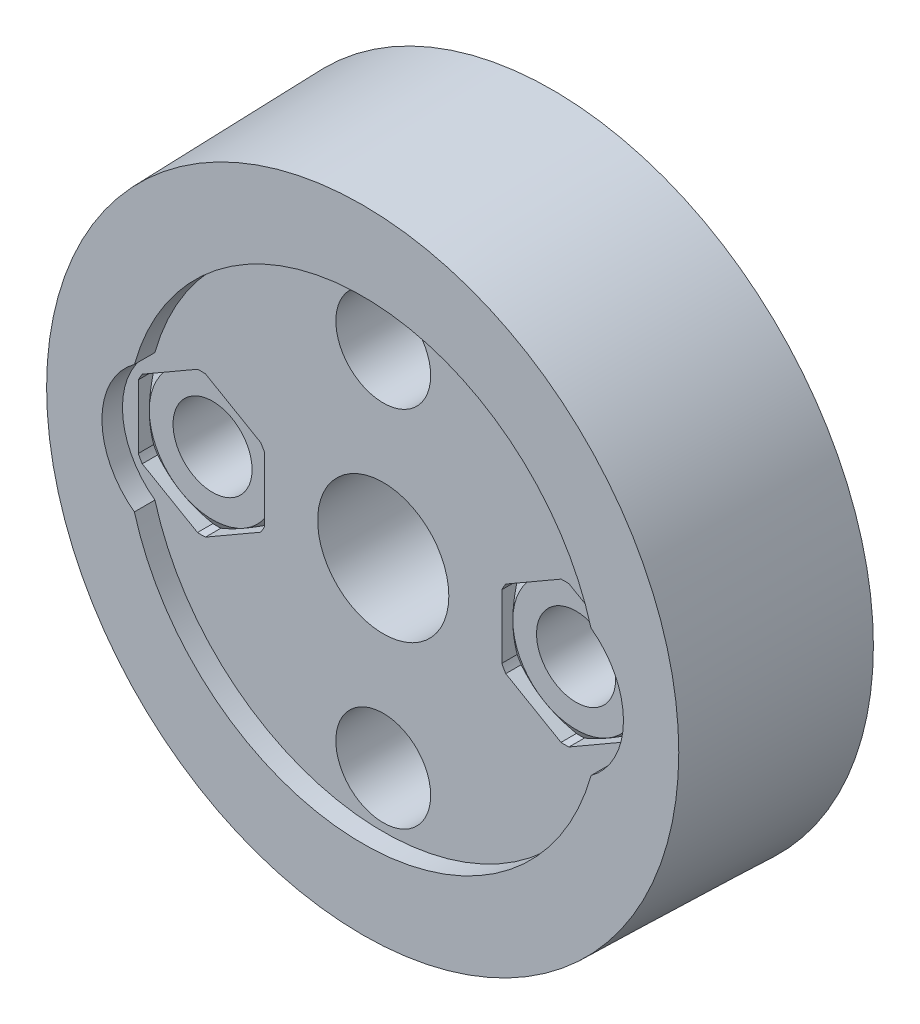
ISO-10303-21;
HEADER;
FILE_DESCRIPTION(('STEP AP214'),'2;1');
FILE_NAME('part.step','',(''),(''),'','','');
FILE_SCHEMA(('AUTOMOTIVE_DESIGN { 1 0 10303 214 1 1 1 1 }'));
ENDSEC;
DATA;
#1=APPLICATION_CONTEXT('core data for automotive mechanical design processes');
#2=APPLICATION_PROTOCOL_DEFINITION('international standard','automotive_design',2000,#1);
#3=PRODUCT_CONTEXT('',#1,'mechanical');
#4=PRODUCT('Part','Part','',(#3));
#5=PRODUCT_RELATED_PRODUCT_CATEGORY('part','',(#4));
#6=PRODUCT_DEFINITION_FORMATION('','',#4);
#7=PRODUCT_DEFINITION_CONTEXT('part definition',#1,'design');
#8=PRODUCT_DEFINITION('design','',#6,#7);
#9=PRODUCT_DEFINITION_SHAPE('','',#8);
#10=(LENGTH_UNIT() NAMED_UNIT(*) SI_UNIT(.MILLI.,.METRE.));
#11=(NAMED_UNIT(*) PLANE_ANGLE_UNIT() SI_UNIT($,.RADIAN.));
#12=(NAMED_UNIT(*) SI_UNIT($,.STERADIAN.) SOLID_ANGLE_UNIT());
#13=UNCERTAINTY_MEASURE_WITH_UNIT(LENGTH_MEASURE(1.E-05),#10,'distance_accuracy_value','');
#14=(GEOMETRIC_REPRESENTATION_CONTEXT(3) GLOBAL_UNCERTAINTY_ASSIGNED_CONTEXT((#13)) GLOBAL_UNIT_ASSIGNED_CONTEXT((#10,
#11,#12)) REPRESENTATION_CONTEXT('',''));
#15=CARTESIAN_POINT('',(0.,0.,0.));
#16=DIRECTION('',(0.,0.,1.));
#17=DIRECTION('',(1.,0.,0.));
#18=AXIS2_PLACEMENT_3D('',#15,#16,#17);
#19=CARTESIAN_POINT('',(-15.5,2.01752323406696,17.5));
#20=DIRECTION('',(1.,0.,0.));
#21=DIRECTION('',(0.,0.,-1.));
#22=AXIS2_PLACEMENT_3D('',#19,#20,#21);
#23=PLANE('',#22);
#24=DIRECTION('',(0.,0.,-1.));
#25=VECTOR('',#24,1.);
#26=CARTESIAN_POINT('',(-15.5,-2.01752323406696,17.5));
#27=LINE('',#26,#25);
#28=CARTESIAN_POINT('',(-15.5,-2.01752323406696,10.7));
#29=VERTEX_POINT('',#28);
#30=CARTESIAN_POINT('',(-15.5,-2.01752323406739,9.72287187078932));
#31=VERTEX_POINT('',#30);
#32=EDGE_CURVE('E561',#29,#31,#27,.T.);
#33=ORIENTED_EDGE('',*,*,#32,.T.);
#34=CARTESIAN_POINT('',(-15.5,-5.76597249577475,8.25779897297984));
#35=CARTESIAN_POINT('',(-15.5,-5.59687588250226,8.33798978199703));
#36=CARTESIAN_POINT('',(-15.5,-5.4273470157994,8.41728711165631));
#37=CARTESIAN_POINT('',(-15.5,-5.08719774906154,8.57359152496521));
#38=CARTESIAN_POINT('',(-15.5,-4.91657714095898,8.65059815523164));
#39=CARTESIAN_POINT('',(-15.5,-4.573038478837,8.80224733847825));
#40=CARTESIAN_POINT('',(-15.5,-4.40011275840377,8.8768725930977));
#41=CARTESIAN_POINT('',(-15.5,-4.05275942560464,9.02252859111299));
#42=CARTESIAN_POINT('',(-15.5,-3.87833189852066,9.09355953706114));
#43=CARTESIAN_POINT('',(-15.5,-3.5267551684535,9.23145430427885));
#44=CARTESIAN_POINT('',(-15.5,-3.34959642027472,9.29829393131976));
#45=CARTESIAN_POINT('',(-15.5,-2.99315183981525,9.4261477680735));
#46=CARTESIAN_POINT('',(-15.5,-2.81386578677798,9.48716136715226));
#47=CARTESIAN_POINT('',(-15.5,-2.45333237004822,9.60162040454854));
#48=CARTESIAN_POINT('',(-15.5,-2.27209060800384,9.65508329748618));
#49=CARTESIAN_POINT('',(-15.5,-1.90711401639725,9.75264886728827));
#50=CARTESIAN_POINT('',(-15.5,-1.72337975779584,9.7967536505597));
#51=CARTESIAN_POINT('',(-15.5,-1.347585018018,9.87463175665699));
#52=CARTESIAN_POINT('',(-15.5,-1.15544557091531,9.90803190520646));
#53=CARTESIAN_POINT('',(-15.5,-0.769135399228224,9.96019091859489));
#54=CARTESIAN_POINT('',(-15.5,-0.574964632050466,9.97894947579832));
#55=CARTESIAN_POINT('',(-15.5,-0.186597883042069,10.0001696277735));
#56=CARTESIAN_POINT('',(-15.5,0.00759396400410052,10.0027049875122));
#57=CARTESIAN_POINT('',(-15.5,0.39545886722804,9.99143676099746));
#58=CARTESIAN_POINT('',(-15.5,0.589132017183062,9.97763636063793));
#59=CARTESIAN_POINT('',(-15.5,0.927717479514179,9.94014618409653));
#60=CARTESIAN_POINT('',(-15.5,1.07300339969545,9.919688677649));
#61=CARTESIAN_POINT('',(-15.5,1.36228646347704,9.87104841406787));
#62=CARTESIAN_POINT('',(-15.5,1.50628337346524,9.84286428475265));
#63=CARTESIAN_POINT('',(-15.5,1.93665085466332,9.74814894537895));
#64=CARTESIAN_POINT('',(-15.5,2.22081358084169,9.67152729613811));
#65=CARTESIAN_POINT('',(-15.5,2.64530530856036,9.54155566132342));
#66=CARTESIAN_POINT('',(-15.5,2.78789680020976,9.49519501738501));
#67=CARTESIAN_POINT('',(-15.5,3.07170622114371,9.3983721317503));
#68=CARTESIAN_POINT('',(-15.5,3.21292403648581,9.34790955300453));
#69=CARTESIAN_POINT('',(-15.5,3.49327458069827,9.24392266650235));
#70=CARTESIAN_POINT('',(-15.5,3.63241467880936,9.19041803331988));
#71=CARTESIAN_POINT('',(-15.5,3.90955225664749,9.08064790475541));
#72=CARTESIAN_POINT('',(-15.5,4.04755008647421,9.02438329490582));
#73=CARTESIAN_POINT('',(-15.5,4.18507301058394,8.96700492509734));
#74=B_SPLINE_CURVE_WITH_KNOTS('',3,(#34,#35,#36,#37,#38,#39,#40,#41,#42,#43,#44,#45,#46,#47,#48,
#49,#50,#51,#52,#53,#54,#55,#56,#57,#58,#59,#60,#61,#62,#63,#64,#65,#66,#67,#68,#69,#70,#71,#72,
#73),.UNSPECIFIED.,.F.,.F.,(4,2,2,2,2,2,2,2,2,2,2,2,2,2,2,2,2,2,2,4),(0.,0.56145175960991,
1.12301391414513,1.68800364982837,2.25296151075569,2.82092664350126,3.38895124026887,
3.95564048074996,4.52220203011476,5.1067816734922,5.6913735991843,6.2733055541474,
6.8551240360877,7.29506136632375,7.73507687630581,8.61686739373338,9.06665546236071,
9.51648052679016,9.96366961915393,10.4107161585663),.UNSPECIFIED.);
#75=CARTESIAN_POINT('',(-15.5,0.,10.));
#76=VERTEX_POINT('',#75);
#77=EDGE_CURVE('E472',#31,#76,#74,.T.);
#78=ORIENTED_EDGE('',*,*,#77,.T.);
#79=CARTESIAN_POINT('',(-15.5,2.01752323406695,9.72287187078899));
#80=VERTEX_POINT('',#79);
#81=EDGE_CURVE('E464',#76,#80,#74,.T.);
#82=ORIENTED_EDGE('',*,*,#81,.T.);
#83=DIRECTION('',(0.,0.,-1.));
#84=VECTOR('',#83,1.);
#85=CARTESIAN_POINT('',(-15.5,2.01752323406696,17.5));
#86=LINE('',#85,#84);
#87=CARTESIAN_POINT('',(-15.5,2.01752323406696,10.7));
#88=VERTEX_POINT('',#87);
#89=EDGE_CURVE('E525',#88,#80,#86,.T.);
#90=ORIENTED_EDGE('',*,*,#89,.F.);
#91=DIRECTION('',(0.,1.,0.));
#92=VECTOR('',#91,1.);
#93=CARTESIAN_POINT('',(-15.5,4.15,10.7));
#94=LINE('',#93,#92);
#95=EDGE_CURVE('E723',#29,#88,#94,.T.);
#96=ORIENTED_EDGE('',*,*,#95,.F.);
#97=EDGE_LOOP('',(#33,#78,#82,#90,#96));
#98=FACE_BOUND('',#97,.T.);
#99=ADVANCED_FACE('F14',(#98),#23,.T.);
#100=CARTESIAN_POINT('',(-11.5,0.,17.5));
#101=DIRECTION('',(0.,0.,-1.));
#102=DIRECTION('',(-1.,0.,0.));
#103=AXIS2_PLACEMENT_3D('',#100,#101,#102);
#104=CYLINDRICAL_SURFACE('',#103,4.4800000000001);
#105=DIRECTION('',(0.,0.,-1.));
#106=VECTOR('',#105,1.);
#107=CARTESIAN_POINT('',(-15.2472263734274,-2.45533999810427,17.5));
#108=LINE('',#107,#106);
#109=CARTESIAN_POINT('',(-15.2472263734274,-2.45533999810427,10.7));
#110=VERTEX_POINT('',#109);
#111=CARTESIAN_POINT('',(-15.2472263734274,-2.45533999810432,9.72287187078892));
#112=VERTEX_POINT('',#111);
#113=EDGE_CURVE('E558',#110,#112,#108,.T.);
#114=ORIENTED_EDGE('',*,*,#113,.T.);
#115=CARTESIAN_POINT('',(-11.5,0.,9.72287187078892));
#116=DIRECTION('',(0.,0.,-1.));
#117=DIRECTION('',(-1.,0.,0.));
#118=AXIS2_PLACEMENT_3D('',#115,#116,#117);
#119=CIRCLE('',#118,4.4800000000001);
#120=EDGE_CURVE('E487',#112,#31,#119,.T.);
#121=ORIENTED_EDGE('',*,*,#120,.T.);
#122=ORIENTED_EDGE('',*,*,#32,.F.);
#123=CARTESIAN_POINT('',(-11.5,0.,10.7));
#124=DIRECTION('',(0.,0.,1.));
#125=DIRECTION('',(1.,0.,0.));
#126=AXIS2_PLACEMENT_3D('',#123,#124,#125);
#127=CIRCLE('',#126,4.4800000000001);
#128=EDGE_CURVE('E720',#110,#29,#127,.F.);
#129=ORIENTED_EDGE('',*,*,#128,.F.);
#130=EDGE_LOOP('',(#114,#121,#122,#129));
#131=FACE_BOUND('',#130,.T.);
#132=ADVANCED_FACE('F451',(#131),#104,.F.);
#133=CARTESIAN_POINT('',(-15.2472263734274,-2.45533999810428,17.5));
#134=DIRECTION('',(0.5,0.866025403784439,0.));
#135=DIRECTION('',(-0.866025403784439,0.5,0.));
#136=AXIS2_PLACEMENT_3D('',#133,#134,#135);
#137=PLANE('',#136);
#138=DIRECTION('',(0.,0.,-1.));
#139=VECTOR('',#138,1.);
#140=CARTESIAN_POINT('',(-11.7527736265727,-4.47286323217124,17.5));
#141=LINE('',#140,#139);
#142=CARTESIAN_POINT('',(-11.7527736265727,-4.47286323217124,10.7));
#143=VERTEX_POINT('',#142);
#144=CARTESIAN_POINT('',(-11.7527736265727,-4.47286323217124,9.72287187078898));
#145=VERTEX_POINT('',#144);
#146=EDGE_CURVE('E555',#143,#145,#141,.T.);
#147=ORIENTED_EDGE('',*,*,#146,.T.);
#148=CARTESIAN_POINT('',(-11.7525736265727,-4.47297870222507,9.72281182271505));
#149=CARTESIAN_POINT('',(-11.8384835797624,-4.42337856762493,9.74860406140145));
#150=CARTESIAN_POINT('',(-11.9247117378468,-4.37359471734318,9.77297975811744));
#151=CARTESIAN_POINT('',(-12.0978231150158,-4.2736488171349,9.81855016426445));
#152=CARTESIAN_POINT('',(-12.1847065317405,-4.22348665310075,9.83974387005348));
#153=CARTESIAN_POINT('',(-12.4465218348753,-4.07232751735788,9.89805910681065));
#154=CARTESIAN_POINT('',(-12.6223865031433,-3.97079200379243,9.92984310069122));
#155=CARTESIAN_POINT('',(-12.9719935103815,-3.76894630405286,9.97605705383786));
#156=CARTESIAN_POINT('',(-13.1456995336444,-3.66865708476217,9.99084734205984));
#157=CARTESIAN_POINT('',(-13.4934351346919,-3.46789184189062,10.0028915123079));
#158=CARTESIAN_POINT('',(-13.6674642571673,-3.36741608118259,10.00016180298));
#159=CARTESIAN_POINT('',(-13.9589183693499,-3.1991449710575,9.98114313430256));
#160=CARTESIAN_POINT('',(-14.0765907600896,-3.13120678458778,9.96948529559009));
#161=CARTESIAN_POINT('',(-14.3112480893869,-2.99572731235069,9.93875677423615));
#162=CARTESIAN_POINT('',(-14.4282327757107,-2.92818617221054,9.91968352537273));
#163=CARTESIAN_POINT('',(-14.662980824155,-2.79265432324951,9.87449792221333));
#164=CARTESIAN_POINT('',(-14.7807291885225,-2.72467227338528,9.84828343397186));
#165=CARTESIAN_POINT('',(-15.0149986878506,-2.5894167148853,9.7898407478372));
#166=CARTESIAN_POINT('',(-15.1315208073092,-2.52214263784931,9.75761783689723));
#167=CARTESIAN_POINT('',(-15.2474263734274,-2.45522452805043,9.72281182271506));
#168=B_SPLINE_CURVE_WITH_KNOTS('',3,(#148,#149,#150,#151,#152,#153,#154,#155,#156,#157,#158,
#159,#160,#161,#162,#163,#164,#165,#166,#167),.UNSPECIFIED.,.F.,.F.,(4,2,2,2,2,2,2,2,2,4),(0.,
0.307477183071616,0.615051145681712,1.2310302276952,1.83369217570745,2.43578977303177,
2.84471905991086,3.25378998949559,3.66905006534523,4.08394645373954),.UNSPECIFIED.);
#169=CARTESIAN_POINT('',(-13.5,-3.46410161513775,10.));
#170=VERTEX_POINT('',#169);
#171=EDGE_CURVE('E247',#145,#170,#168,.T.);
#172=ORIENTED_EDGE('',*,*,#171,.T.);
#173=EDGE_CURVE('E274',#170,#112,#168,.T.);
#174=ORIENTED_EDGE('',*,*,#173,.T.);
#175=ORIENTED_EDGE('',*,*,#113,.F.);
#176=DIRECTION('',(-0.866025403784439,0.5,0.));
#177=VECTOR('',#176,1.);
#178=CARTESIAN_POINT('',(-6.67200271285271,-7.40624768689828,10.7));
#179=LINE('',#178,#177);
#180=EDGE_CURVE('E717',#143,#110,#179,.T.);
#181=ORIENTED_EDGE('',*,*,#180,.F.);
#182=EDGE_LOOP('',(#147,#172,#174,#175,#181));
#183=FACE_BOUND('',#182,.T.);
#184=ADVANCED_FACE('F457',(#183),#137,.T.);
#185=CARTESIAN_POINT('',(-11.5,-7.30318583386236E-13,17.5));
#186=DIRECTION('',(0.,0.,-1.));
#187=DIRECTION('',(-1.,0.,0.));
#188=AXIS2_PLACEMENT_3D('',#185,#186,#187);
#189=CYLINDRICAL_SURFACE('',#188,4.47999999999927);
#190=DIRECTION('',(0.,0.,-1.));
#191=VECTOR('',#190,1.);
#192=CARTESIAN_POINT('',(-11.2472263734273,-4.47286323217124,17.5));
#193=LINE('',#192,#191);
#194=CARTESIAN_POINT('',(-11.2472263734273,-4.47286323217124,10.7));
#195=VERTEX_POINT('',#194);
#196=CARTESIAN_POINT('',(-11.2472263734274,-4.4728632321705,9.7228718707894));
#197=VERTEX_POINT('',#196);
#198=EDGE_CURVE('E552',#195,#197,#193,.T.);
#199=ORIENTED_EDGE('',*,*,#198,.T.);
#200=CARTESIAN_POINT('',(-11.5,0.,9.7228718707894));
#201=DIRECTION('',(0.,0.,-1.));
#202=DIRECTION('',(-1.,0.,0.));
#203=AXIS2_PLACEMENT_3D('',#200,#201,#202);
#204=CIRCLE('',#203,4.47999999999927);
#205=EDGE_CURVE('E319',#197,#145,#204,.T.);
#206=ORIENTED_EDGE('',*,*,#205,.T.);
#207=ORIENTED_EDGE('',*,*,#146,.F.);
#208=CARTESIAN_POINT('',(-11.5,-7.30318583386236E-13,10.7));
#209=DIRECTION('',(0.,0.,1.));
#210=DIRECTION('',(1.,0.,0.));
#211=AXIS2_PLACEMENT_3D('',#208,#209,#210);
#212=CIRCLE('',#211,4.47999999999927);
#213=EDGE_CURVE('E714',#195,#143,#212,.F.);
#214=ORIENTED_EDGE('',*,*,#213,.F.);
#215=EDGE_LOOP('',(#199,#206,#207,#214));
#216=FACE_BOUND('',#215,.T.);
#217=ADVANCED_FACE('F310',(#216),#189,.F.);
#218=CARTESIAN_POINT('',(-11.2472263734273,-4.47286323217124,17.5));
#219=DIRECTION('',(-0.5,0.866025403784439,0.));
#220=DIRECTION('',(-0.866025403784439,-0.5,0.));
#221=AXIS2_PLACEMENT_3D('',#218,#219,#220);
#222=PLANE('',#221);
#223=DIRECTION('',(0.,0.,-1.));
#224=VECTOR('',#223,1.);
#225=CARTESIAN_POINT('',(-7.75277362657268,-2.45533999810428,17.5));
#226=LINE('',#225,#224);
#227=CARTESIAN_POINT('',(-7.75277362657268,-2.45533999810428,10.7));
#228=VERTEX_POINT('',#227);
#229=CARTESIAN_POINT('',(-7.75277362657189,-2.45533999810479,9.72287187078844));
#230=VERTEX_POINT('',#229);
#231=EDGE_CURVE('E549',#228,#230,#226,.T.);
#232=ORIENTED_EDGE('',*,*,#231,.T.);
#233=CARTESIAN_POINT('',(-7.75257362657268,-2.45522452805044,9.72281182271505));
#234=CARTESIAN_POINT('',(-7.83848357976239,-2.50482466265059,9.74860406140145));
#235=CARTESIAN_POINT('',(-7.92471173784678,-2.55460851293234,9.77297975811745));
#236=CARTESIAN_POINT('',(-8.09782311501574,-2.65455441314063,9.81855016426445));
#237=CARTESIAN_POINT('',(-8.18470653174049,-2.70471657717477,9.83974387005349));
#238=CARTESIAN_POINT('',(-8.44652183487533,-2.85587571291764,9.89805910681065));
#239=CARTESIAN_POINT('',(-8.62238650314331,-2.9574112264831,9.92984310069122));
#240=CARTESIAN_POINT('',(-8.97199351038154,-3.15925692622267,9.97605705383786));
#241=CARTESIAN_POINT('',(-9.14569953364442,-3.25954614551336,9.99084734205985));
#242=CARTESIAN_POINT('',(-9.49343513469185,-3.46031138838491,10.0028915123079));
#243=CARTESIAN_POINT('',(-9.66746425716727,-3.56078714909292,10.00016180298));
#244=CARTESIAN_POINT('',(-9.95891836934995,-3.72905825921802,9.98114313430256));
#245=CARTESIAN_POINT('',(-10.0765907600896,-3.79699644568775,9.96948529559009));
#246=CARTESIAN_POINT('',(-10.3112480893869,-3.93247591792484,9.93875677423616));
#247=CARTESIAN_POINT('',(-10.4282327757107,-4.00001705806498,9.91968352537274));
#248=CARTESIAN_POINT('',(-10.662980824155,-4.135548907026,9.87449792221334));
#249=CARTESIAN_POINT('',(-10.7807291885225,-4.20353095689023,9.84828343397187));
#250=CARTESIAN_POINT('',(-11.0149986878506,-4.33878651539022,9.78984074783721));
#251=CARTESIAN_POINT('',(-11.1315208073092,-4.40606059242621,9.75761783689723));
#252=CARTESIAN_POINT('',(-11.2474263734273,-4.47297870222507,9.72281182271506));
#253=B_SPLINE_CURVE_WITH_KNOTS('',3,(#233,#234,#235,#236,#237,#238,#239,#240,#241,#242,#243,
#244,#245,#246,#247,#248,#249,#250,#251,#252),.UNSPECIFIED.,.F.,.F.,(4,2,2,2,2,2,2,2,2,4),(0.,
0.307477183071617,0.615051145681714,1.23103022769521,1.83369217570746,2.43578977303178,
2.84471905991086,3.25378998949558,3.66905006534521,4.08394645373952),.UNSPECIFIED.);
#254=CARTESIAN_POINT('',(-9.5,-3.46410161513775,10.));
#255=VERTEX_POINT('',#254);
#256=EDGE_CURVE('E313',#230,#255,#253,.T.);
#257=ORIENTED_EDGE('',*,*,#256,.T.);
#258=EDGE_CURVE('E320',#255,#197,#253,.T.);
#259=ORIENTED_EDGE('',*,*,#258,.T.);
#260=ORIENTED_EDGE('',*,*,#198,.F.);
#261=DIRECTION('',(-0.866025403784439,-0.5,0.));
#262=VECTOR('',#261,1.);
#263=CARTESIAN_POINT('',(0.922002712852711,2.55304445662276,10.7));
#264=LINE('',#263,#262);
#265=EDGE_CURVE('E711',#228,#195,#264,.T.);
#266=ORIENTED_EDGE('',*,*,#265,.F.);
#267=EDGE_LOOP('',(#232,#257,#259,#260,#266));
#268=FACE_BOUND('',#267,.T.);
#269=ADVANCED_FACE('F305',(#268),#222,.T.);
#270=CARTESIAN_POINT('',(-11.5000000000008,4.67941657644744E-13,17.5));
#271=DIRECTION('',(0.,0.,-1.));
#272=DIRECTION('',(-1.,0.,0.));
#273=AXIS2_PLACEMENT_3D('',#270,#271,#272);
#274=CYLINDRICAL_SURFACE('',#273,4.48000000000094);
#275=DIRECTION('',(0.,0.,-1.));
#276=VECTOR('',#275,1.);
#277=CARTESIAN_POINT('',(-7.5,-2.01752323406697,17.5));
#278=LINE('',#277,#276);
#279=CARTESIAN_POINT('',(-7.5,-2.01752323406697,10.7));
#280=VERTEX_POINT('',#279);
#281=CARTESIAN_POINT('',(-7.5,-2.01752323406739,9.72287187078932));
#282=VERTEX_POINT('',#281);
#283=EDGE_CURVE('E547',#280,#282,#278,.T.);
#284=ORIENTED_EDGE('',*,*,#283,.T.);
#285=CARTESIAN_POINT('',(-11.5,0.,9.72287187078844));
#286=DIRECTION('',(0.,0.,-1.));
#287=DIRECTION('',(-1.,0.,0.));
#288=AXIS2_PLACEMENT_3D('',#285,#286,#287);
#289=CIRCLE('',#288,4.48000000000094);
#290=EDGE_CURVE('E242',#282,#230,#289,.T.);
#291=ORIENTED_EDGE('',*,*,#290,.T.);
#292=ORIENTED_EDGE('',*,*,#231,.F.);
#293=CARTESIAN_POINT('',(-11.5000000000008,4.67941657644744E-13,10.7));
#294=DIRECTION('',(0.,0.,1.));
#295=DIRECTION('',(1.,0.,0.));
#296=AXIS2_PLACEMENT_3D('',#293,#294,#295);
#297=CIRCLE('',#296,4.48000000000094);
#298=EDGE_CURVE('E708',#280,#228,#297,.F.);
#299=ORIENTED_EDGE('',*,*,#298,.F.);
#300=EDGE_LOOP('',(#284,#291,#292,#299));
#301=FACE_BOUND('',#300,.T.);
#302=ADVANCED_FACE('F301',(#301),#274,.F.);
#303=CARTESIAN_POINT('',(-7.5,-2.01752323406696,17.5));
#304=DIRECTION('',(-1.,0.,0.));
#305=DIRECTION('',(0.,0.,1.));
#306=AXIS2_PLACEMENT_3D('',#303,#304,#305);
#307=PLANE('',#306);
#308=DIRECTION('',(0.,0.,-1.));
#309=VECTOR('',#308,1.);
#310=CARTESIAN_POINT('',(-7.5,2.01752323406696,17.5));
#311=LINE('',#310,#309);
#312=CARTESIAN_POINT('',(-7.5,2.01752323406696,10.7));
#313=VERTEX_POINT('',#312);
#314=CARTESIAN_POINT('',(-7.49999999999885,2.01752323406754,9.72287187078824));
#315=VERTEX_POINT('',#314);
#316=EDGE_CURVE('E273',#313,#315,#311,.T.);
#317=ORIENTED_EDGE('',*,*,#316,.T.);
#318=CARTESIAN_POINT('',(-7.5,-5.76597249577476,8.25779897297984));
#319=CARTESIAN_POINT('',(-7.5,-5.59687588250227,8.33798978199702));
#320=CARTESIAN_POINT('',(-7.5,-5.42734701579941,8.4172871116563));
#321=CARTESIAN_POINT('',(-7.5,-5.08719774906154,8.5735915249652));
#322=CARTESIAN_POINT('',(-7.5,-4.91657714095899,8.65059815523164));
#323=CARTESIAN_POINT('',(-7.5,-4.57303847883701,8.80224733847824));
#324=CARTESIAN_POINT('',(-7.5,-4.40011275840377,8.87687259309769));
#325=CARTESIAN_POINT('',(-7.5,-4.05275942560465,9.02252859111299));
#326=CARTESIAN_POINT('',(-7.5,-3.87833189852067,9.09355953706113));
#327=CARTESIAN_POINT('',(-7.5,-3.52675516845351,9.23145430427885));
#328=CARTESIAN_POINT('',(-7.5,-3.34959642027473,9.29829393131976));
#329=CARTESIAN_POINT('',(-7.5,-2.99315183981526,9.4261477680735));
#330=CARTESIAN_POINT('',(-7.5,-2.81386578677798,9.48716136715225));
#331=CARTESIAN_POINT('',(-7.5,-2.45333237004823,9.60162040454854));
#332=CARTESIAN_POINT('',(-7.5,-2.27209060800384,9.65508329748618));
#333=CARTESIAN_POINT('',(-7.5,-1.90711401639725,9.75264886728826));
#334=CARTESIAN_POINT('',(-7.5,-1.72337975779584,9.7967536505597));
#335=CARTESIAN_POINT('',(-7.5,-1.347585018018,9.87463175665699));
#336=CARTESIAN_POINT('',(-7.5,-1.15544557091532,9.90803190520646));
#337=CARTESIAN_POINT('',(-7.5,-0.769135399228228,9.96019091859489));
#338=CARTESIAN_POINT('',(-7.5,-0.57496463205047,9.97894947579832));
#339=CARTESIAN_POINT('',(-7.5,-0.186597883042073,10.0001696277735));
#340=CARTESIAN_POINT('',(-7.5,0.00759396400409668,10.0027049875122));
#341=CARTESIAN_POINT('',(-7.5,0.395458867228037,9.99143676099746));
#342=CARTESIAN_POINT('',(-7.5,0.589132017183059,9.97763636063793));
#343=CARTESIAN_POINT('',(-7.5,0.927717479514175,9.94014618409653));
#344=CARTESIAN_POINT('',(-7.5,1.07300339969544,9.919688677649));
#345=CARTESIAN_POINT('',(-7.5,1.36228646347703,9.87104841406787));
#346=CARTESIAN_POINT('',(-7.5,1.50628337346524,9.84286428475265));
#347=CARTESIAN_POINT('',(-7.5,1.93665085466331,9.74814894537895));
#348=CARTESIAN_POINT('',(-7.5,2.22081358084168,9.67152729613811));
#349=CARTESIAN_POINT('',(-7.5,2.64530530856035,9.54155566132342));
#350=CARTESIAN_POINT('',(-7.5,2.78789680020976,9.49519501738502));
#351=CARTESIAN_POINT('',(-7.5,3.0717062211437,9.3983721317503));
#352=CARTESIAN_POINT('',(-7.5,3.21292403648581,9.34790955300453));
#353=CARTESIAN_POINT('',(-7.5,3.49327458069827,9.24392266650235));
#354=CARTESIAN_POINT('',(-7.5,3.63241467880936,9.19041803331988));
#355=CARTESIAN_POINT('',(-7.5,3.90955225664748,9.08064790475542));
#356=CARTESIAN_POINT('',(-7.5,4.0475500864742,9.02438329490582));
#357=CARTESIAN_POINT('',(-7.5,4.18507301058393,8.96700492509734));
#358=B_SPLINE_CURVE_WITH_KNOTS('',3,(#318,#319,#320,#321,#322,#323,#324,#325,#326,#327,#328,
#329,#330,#331,#332,#333,#334,#335,#336,#337,#338,#339,#340,#341,#342,#343,#344,#345,#346,#347,
#348,#349,#350,#351,#352,#353,#354,#355,#356,#357),.UNSPECIFIED.,.F.,.F.,(4,2,2,2,2,2,2,2,2,2,2,
2,2,2,2,2,2,2,2,4),(0.,0.56145175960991,1.12301391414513,1.68800364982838,2.25296151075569,
2.82092664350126,3.38895124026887,3.95564048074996,4.52220203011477,5.10678167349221,
5.69137359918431,6.2733055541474,6.85512403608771,7.29506136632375,7.73507687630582,
8.61686739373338,9.06665546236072,9.51648052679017,9.96366961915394,10.4107161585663),.UNSPECIFIED.);
#359=CARTESIAN_POINT('',(-7.5,0.,10.));
#360=VERTEX_POINT('',#359);
#361=EDGE_CURVE('E249',#315,#360,#358,.F.);
#362=ORIENTED_EDGE('',*,*,#361,.T.);
#363=EDGE_CURVE('E236',#360,#282,#358,.F.);
#364=ORIENTED_EDGE('',*,*,#363,.T.);
#365=ORIENTED_EDGE('',*,*,#283,.F.);
#366=DIRECTION('',(0.,-1.,0.));
#367=VECTOR('',#366,1.);
#368=CARTESIAN_POINT('',(-7.5,4.15,10.7));
#369=LINE('',#368,#367);
#370=EDGE_CURVE('E705',#313,#280,#369,.T.);
#371=ORIENTED_EDGE('',*,*,#370,.F.);
#372=EDGE_LOOP('',(#317,#362,#364,#365,#371));
#373=FACE_BOUND('',#372,.T.);
#374=ADVANCED_FACE('F271',(#373),#307,.T.);
#375=CARTESIAN_POINT('',(-11.5000000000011,-6.41414005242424E-13,17.5));
#376=DIRECTION('',(0.,0.,-1.));
#377=DIRECTION('',(-1.,0.,0.));
#378=AXIS2_PLACEMENT_3D('',#375,#376,#377);
#379=CYLINDRICAL_SURFACE('',#378,4.48000000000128);
#380=DIRECTION('',(0.,0.,-1.));
#381=VECTOR('',#380,1.);
#382=CARTESIAN_POINT('',(-7.75277362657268,2.45533999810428,17.5));
#383=LINE('',#382,#381);
#384=CARTESIAN_POINT('',(-7.75277362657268,2.45533999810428,10.7));
#385=VERTEX_POINT('',#384);
#386=CARTESIAN_POINT('',(-7.75277362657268,2.45533999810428,9.72287187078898));
#387=VERTEX_POINT('',#386);
#388=EDGE_CURVE('E543',#385,#387,#383,.T.);
#389=ORIENTED_EDGE('',*,*,#388,.T.);
#390=CARTESIAN_POINT('',(-11.5,0.,9.72287187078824));
#391=DIRECTION('',(0.,0.,-1.));
#392=DIRECTION('',(-1.,0.,0.));
#393=AXIS2_PLACEMENT_3D('',#390,#391,#392);
#394=CIRCLE('',#393,4.48000000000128);
#395=EDGE_CURVE('E275',#387,#315,#394,.T.);
#396=ORIENTED_EDGE('',*,*,#395,.T.);
#397=ORIENTED_EDGE('',*,*,#316,.F.);
#398=CARTESIAN_POINT('',(-11.5000000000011,-6.41414005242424E-13,10.7));
#399=DIRECTION('',(0.,0.,1.));
#400=DIRECTION('',(1.,0.,0.));
#401=AXIS2_PLACEMENT_3D('',#398,#399,#400);
#402=CIRCLE('',#401,4.48000000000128);
#403=EDGE_CURVE('E702',#385,#313,#402,.F.);
#404=ORIENTED_EDGE('',*,*,#403,.F.);
#405=EDGE_LOOP('',(#389,#396,#397,#404));
#406=FACE_BOUND('',#405,.T.);
#407=ADVANCED_FACE('F300',(#406),#379,.F.);
#408=CARTESIAN_POINT('',(-7.75277362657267,2.45533999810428,17.5));
#409=DIRECTION('',(-0.5,-0.866025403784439,0.));
#410=DIRECTION('',(0.866025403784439,-0.5,0.));
#411=AXIS2_PLACEMENT_3D('',#408,#409,#410);
#412=PLANE('',#411);
#413=DIRECTION('',(0.,0.,-1.));
#414=VECTOR('',#413,1.);
#415=CARTESIAN_POINT('',(-11.2472263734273,4.47286323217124,17.5));
#416=LINE('',#415,#414);
#417=CARTESIAN_POINT('',(-11.2472263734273,4.47286323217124,10.7));
#418=VERTEX_POINT('',#417);
#419=CARTESIAN_POINT('',(-11.2472263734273,4.47286323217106,9.72287187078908));
#420=VERTEX_POINT('',#419);
#421=EDGE_CURVE('E540',#418,#420,#416,.T.);
#422=ORIENTED_EDGE('',*,*,#421,.T.);
#423=CARTESIAN_POINT('',(-11.2474263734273,4.47297870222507,9.72281182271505));
#424=CARTESIAN_POINT('',(-11.1615164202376,4.42337856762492,9.74860406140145));
#425=CARTESIAN_POINT('',(-11.0752882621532,4.37359471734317,9.77297975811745));
#426=CARTESIAN_POINT('',(-10.9021768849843,4.27364881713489,9.81855016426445));
#427=CARTESIAN_POINT('',(-10.8152934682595,4.22348665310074,9.83974387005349));
#428=CARTESIAN_POINT('',(-10.5534781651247,4.07232751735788,9.89805910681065));
#429=CARTESIAN_POINT('',(-10.3776134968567,3.97079200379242,9.92984310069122));
#430=CARTESIAN_POINT('',(-10.0280064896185,3.76894630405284,9.97605705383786));
#431=CARTESIAN_POINT('',(-9.85430046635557,3.66865708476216,9.99084734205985));
#432=CARTESIAN_POINT('',(-9.50656486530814,3.46789184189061,10.0028915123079));
#433=CARTESIAN_POINT('',(-9.33253574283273,3.36741608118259,10.00016180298));
#434=CARTESIAN_POINT('',(-9.04108163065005,3.1991449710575,9.98114313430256));
#435=CARTESIAN_POINT('',(-8.92340923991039,3.13120678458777,9.96948529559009));
#436=CARTESIAN_POINT('',(-8.68875191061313,2.99572731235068,9.93875677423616));
#437=CARTESIAN_POINT('',(-8.57176722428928,2.92818617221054,9.91968352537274));
#438=CARTESIAN_POINT('',(-8.33701917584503,2.79265432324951,9.87449792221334));
#439=CARTESIAN_POINT('',(-8.2192708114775,2.72467227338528,9.84828343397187));
#440=CARTESIAN_POINT('',(-7.98500131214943,2.5894167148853,9.78984074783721));
#441=CARTESIAN_POINT('',(-7.86847919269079,2.52214263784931,9.75761783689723));
#442=CARTESIAN_POINT('',(-7.75257362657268,2.45522452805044,9.72281182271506));
#443=B_SPLINE_CURVE_WITH_KNOTS('',3,(#423,#424,#425,#426,#427,#428,#429,#430,#431,#432,#433,
#434,#435,#436,#437,#438,#439,#440,#441,#442),.UNSPECIFIED.,.F.,.F.,(4,2,2,2,2,2,2,2,2,4),(0.,
0.307477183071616,0.615051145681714,1.23103022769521,1.83369217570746,2.43578977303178,
2.84471905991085,3.25378998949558,3.66905006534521,4.08394645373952),.UNSPECIFIED.);
#444=CARTESIAN_POINT('',(-9.5,3.46410161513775,10.));
#445=VERTEX_POINT('',#444);
#446=EDGE_CURVE('E481',#420,#445,#443,.T.);
#447=ORIENTED_EDGE('',*,*,#446,.T.);
#448=EDGE_CURVE('E267',#445,#387,#443,.T.);
#449=ORIENTED_EDGE('',*,*,#448,.T.);
#450=ORIENTED_EDGE('',*,*,#388,.F.);
#451=DIRECTION('',(0.866025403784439,-0.5,0.));
#452=VECTOR('',#451,1.);
#453=CARTESIAN_POINT('',(-2.67200271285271,-0.478044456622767,10.7));
#454=LINE('',#453,#452);
#455=EDGE_CURVE('E699',#418,#385,#454,.T.);
#456=ORIENTED_EDGE('',*,*,#455,.F.);
#457=EDGE_LOOP('',(#422,#447,#449,#450,#456));
#458=FACE_BOUND('',#457,.T.);
#459=ADVANCED_FACE('F488',(#458),#412,.T.);
#460=CARTESIAN_POINT('',(-11.5,1.70870262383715E-13,17.5));
#461=DIRECTION('',(0.,0.,-1.));
#462=DIRECTION('',(-1.,0.,0.));
#463=AXIS2_PLACEMENT_3D('',#460,#461,#462);
#464=CYLINDRICAL_SURFACE('',#463,4.47999999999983);
#465=DIRECTION('',(0.,0.,-1.));
#466=VECTOR('',#465,1.);
#467=CARTESIAN_POINT('',(-11.7527736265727,4.47286323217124,17.5));
#468=LINE('',#467,#466);
#469=CARTESIAN_POINT('',(-11.7527736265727,4.47286323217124,10.7));
#470=VERTEX_POINT('',#469);
#471=CARTESIAN_POINT('',(-11.7527736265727,4.47286323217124,9.72287187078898));
#472=VERTEX_POINT('',#471);
#473=EDGE_CURVE('E537',#470,#472,#468,.T.);
#474=ORIENTED_EDGE('',*,*,#473,.T.);
#475=CARTESIAN_POINT('',(-11.5,0.,9.72287187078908));
#476=DIRECTION('',(0.,0.,-1.));
#477=DIRECTION('',(-1.,0.,0.));
#478=AXIS2_PLACEMENT_3D('',#475,#476,#477);
#479=CIRCLE('',#478,4.47999999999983);
#480=EDGE_CURVE('E478',#472,#420,#479,.T.);
#481=ORIENTED_EDGE('',*,*,#480,.T.);
#482=ORIENTED_EDGE('',*,*,#421,.F.);
#483=CARTESIAN_POINT('',(-11.5,1.70870262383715E-13,10.7));
#484=DIRECTION('',(0.,0.,1.));
#485=DIRECTION('',(1.,0.,0.));
#486=AXIS2_PLACEMENT_3D('',#483,#484,#485);
#487=CIRCLE('',#486,4.47999999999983);
#488=EDGE_CURVE('E696',#470,#418,#487,.F.);
#489=ORIENTED_EDGE('',*,*,#488,.F.);
#490=EDGE_LOOP('',(#474,#481,#482,#489));
#491=FACE_BOUND('',#490,.T.);
#492=ADVANCED_FACE('F492',(#491),#464,.F.);
#493=CARTESIAN_POINT('',(-11.7527736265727,4.47286323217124,17.5));
#494=DIRECTION('',(0.5,-0.866025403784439,0.));
#495=DIRECTION('',(0.866025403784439,0.5,0.));
#496=AXIS2_PLACEMENT_3D('',#493,#494,#495);
#497=PLANE('',#496);
#498=DIRECTION('',(0.,0.,-1.));
#499=VECTOR('',#498,1.);
#500=CARTESIAN_POINT('',(-15.2472263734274,2.45533999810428,17.5));
#501=LINE('',#500,#499);
#502=CARTESIAN_POINT('',(-15.2472263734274,2.45533999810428,10.7));
#503=VERTEX_POINT('',#502);
#504=CARTESIAN_POINT('',(-15.2472263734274,2.45533999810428,9.72287187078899));
#505=VERTEX_POINT('',#504);
#506=EDGE_CURVE('E534',#503,#505,#501,.T.);
#507=ORIENTED_EDGE('',*,*,#506,.T.);
#508=CARTESIAN_POINT('',(-15.2474263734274,2.45522452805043,9.72281182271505));
#509=CARTESIAN_POINT('',(-15.1615164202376,2.50482466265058,9.74860406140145));
#510=CARTESIAN_POINT('',(-15.0752882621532,2.55460851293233,9.77297975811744));
#511=CARTESIAN_POINT('',(-14.9021768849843,2.65455441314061,9.81855016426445));
#512=CARTESIAN_POINT('',(-14.8152934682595,2.70471657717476,9.83974387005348));
#513=CARTESIAN_POINT('',(-14.5534781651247,2.85587571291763,9.89805910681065));
#514=CARTESIAN_POINT('',(-14.3776134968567,2.95741122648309,9.92984310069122));
#515=CARTESIAN_POINT('',(-14.0280064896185,3.15925692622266,9.97605705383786));
#516=CARTESIAN_POINT('',(-13.8543004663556,3.25954614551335,9.99084734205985));
#517=CARTESIAN_POINT('',(-13.5065648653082,3.4603113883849,10.0028915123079));
#518=CARTESIAN_POINT('',(-13.3325357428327,3.56078714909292,10.00016180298));
#519=CARTESIAN_POINT('',(-13.0410816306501,3.72905825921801,9.98114313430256));
#520=CARTESIAN_POINT('',(-12.9234092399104,3.79699644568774,9.96948529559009));
#521=CARTESIAN_POINT('',(-12.6887519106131,3.93247591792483,9.93875677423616));
#522=CARTESIAN_POINT('',(-12.5717672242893,4.00001705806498,9.91968352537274));
#523=CARTESIAN_POINT('',(-12.337019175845,4.135548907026,9.87449792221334));
#524=CARTESIAN_POINT('',(-12.2192708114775,4.20353095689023,9.84828343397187));
#525=CARTESIAN_POINT('',(-11.9850013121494,4.33878651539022,9.78984074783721));
#526=CARTESIAN_POINT('',(-11.8684791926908,4.40606059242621,9.75761783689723));
#527=CARTESIAN_POINT('',(-11.7525736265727,4.47297870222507,9.72281182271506));
#528=B_SPLINE_CURVE_WITH_KNOTS('',3,(#508,#509,#510,#511,#512,#513,#514,#515,#516,#517,#518,
#519,#520,#521,#522,#523,#524,#525,#526,#527),.UNSPECIFIED.,.F.,.F.,(4,2,2,2,2,2,2,2,2,4),(0.,
0.307477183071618,0.615051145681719,1.23103022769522,1.83369217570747,2.4357897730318,
2.84471905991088,3.25378998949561,3.66905006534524,4.08394645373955),.UNSPECIFIED.);
#529=CARTESIAN_POINT('',(-13.5,3.46410161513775,10.));
#530=VERTEX_POINT('',#529);
#531=EDGE_CURVE('E29',#505,#530,#528,.T.);
#532=ORIENTED_EDGE('',*,*,#531,.T.);
#533=EDGE_CURVE('E482',#530,#472,#528,.T.);
#534=ORIENTED_EDGE('',*,*,#533,.T.);
#535=ORIENTED_EDGE('',*,*,#473,.F.);
#536=DIRECTION('',(0.866025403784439,0.5,0.));
#537=VECTOR('',#536,1.);
#538=CARTESIAN_POINT('',(-3.0779972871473,9.48124768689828,10.7));
#539=LINE('',#538,#537);
#540=EDGE_CURVE('E693',#503,#470,#539,.T.);
#541=ORIENTED_EDGE('',*,*,#540,.F.);
#542=EDGE_LOOP('',(#507,#532,#534,#535,#541));
#543=FACE_BOUND('',#542,.T.);
#544=ADVANCED_FACE('F495',(#543),#497,.T.);
#545=CARTESIAN_POINT('',(-11.5,0.,17.5));
#546=DIRECTION('',(0.,0.,-1.));
#547=DIRECTION('',(-1.,0.,0.));
#548=AXIS2_PLACEMENT_3D('',#545,#546,#547);
#549=CYLINDRICAL_SURFACE('',#548,4.48);
#550=ORIENTED_EDGE('',*,*,#89,.T.);
#551=CARTESIAN_POINT('',(-11.5,0.,9.72287187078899));
#552=DIRECTION('',(0.,0.,-1.));
#553=DIRECTION('',(-1.,0.,0.));
#554=AXIS2_PLACEMENT_3D('',#551,#552,#553);
#555=CIRCLE('',#554,4.48);
#556=EDGE_CURVE('E9',#80,#505,#555,.T.);
#557=ORIENTED_EDGE('',*,*,#556,.T.);
#558=ORIENTED_EDGE('',*,*,#506,.F.);
#559=CARTESIAN_POINT('',(-11.5,0.,10.7));
#560=DIRECTION('',(0.,0.,1.));
#561=DIRECTION('',(1.,0.,0.));
#562=AXIS2_PLACEMENT_3D('',#559,#560,#561);
#563=CIRCLE('',#562,4.48);
#564=EDGE_CURVE('E690',#88,#503,#563,.F.);
#565=ORIENTED_EDGE('',*,*,#564,.F.);
#566=EDGE_LOOP('',(#550,#557,#558,#565));
#567=FACE_BOUND('',#566,.T.);
#568=ADVANCED_FACE('F405',(#567),#549,.F.);
#569=CARTESIAN_POINT('',(7.5,2.01752323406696,17.5));
#570=DIRECTION('',(1.,0.,0.));
#571=DIRECTION('',(0.,0.,-1.));
#572=AXIS2_PLACEMENT_3D('',#569,#570,#571);
#573=PLANE('',#572);
#574=DIRECTION('',(0.,0.,-1.));
#575=VECTOR('',#574,1.);
#576=CARTESIAN_POINT('',(7.5,-2.01752323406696,17.5));
#577=LINE('',#576,#575);
#578=CARTESIAN_POINT('',(7.5,-2.01752323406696,10.7));
#579=VERTEX_POINT('',#578);
#580=CARTESIAN_POINT('',(7.5,-2.01752323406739,9.72287187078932));
#581=VERTEX_POINT('',#580);
#582=EDGE_CURVE('E596',#579,#581,#577,.T.);
#583=ORIENTED_EDGE('',*,*,#582,.T.);
#584=CARTESIAN_POINT('',(7.5,-5.76597249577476,8.25779897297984));
#585=CARTESIAN_POINT('',(7.5,-5.59687588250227,8.33798978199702));
#586=CARTESIAN_POINT('',(7.5,-5.42734701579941,8.4172871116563));
#587=CARTESIAN_POINT('',(7.5,-5.08719774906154,8.5735915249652));
#588=CARTESIAN_POINT('',(7.5,-4.91657714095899,8.65059815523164));
#589=CARTESIAN_POINT('',(7.5,-4.57303847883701,8.80224733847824));
#590=CARTESIAN_POINT('',(7.5,-4.40011275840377,8.8768725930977));
#591=CARTESIAN_POINT('',(7.5,-4.05275942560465,9.02252859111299));
#592=CARTESIAN_POINT('',(7.5,-3.87833189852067,9.09355953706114));
#593=CARTESIAN_POINT('',(7.5,-3.5267551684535,9.23145430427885));
#594=CARTESIAN_POINT('',(7.5,-3.34959642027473,9.29829393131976));
#595=CARTESIAN_POINT('',(7.5,-2.99315183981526,9.4261477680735));
#596=CARTESIAN_POINT('',(7.5,-2.81386578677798,9.48716136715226));
#597=CARTESIAN_POINT('',(7.5,-2.45333237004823,9.60162040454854));
#598=CARTESIAN_POINT('',(7.5,-2.27209060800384,9.65508329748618));
#599=CARTESIAN_POINT('',(7.5,-1.90711401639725,9.75264886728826));
#600=CARTESIAN_POINT('',(7.5,-1.72337975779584,9.7967536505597));
#601=CARTESIAN_POINT('',(7.5,-1.347585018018,9.87463175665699));
#602=CARTESIAN_POINT('',(7.5,-1.15544557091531,9.90803190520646));
#603=CARTESIAN_POINT('',(7.5,-0.769135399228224,9.96019091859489));
#604=CARTESIAN_POINT('',(7.5,-0.574964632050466,9.97894947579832));
#605=CARTESIAN_POINT('',(7.5,-0.186597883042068,10.0001696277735));
#606=CARTESIAN_POINT('',(7.5,0.00759396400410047,10.0027049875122));
#607=CARTESIAN_POINT('',(7.5,0.39545886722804,9.99143676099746));
#608=CARTESIAN_POINT('',(7.5,0.589132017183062,9.97763636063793));
#609=CARTESIAN_POINT('',(7.5,0.927717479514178,9.94014618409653));
#610=CARTESIAN_POINT('',(7.5,1.07300339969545,9.919688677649));
#611=CARTESIAN_POINT('',(7.5,1.36228646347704,9.87104841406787));
#612=CARTESIAN_POINT('',(7.5,1.50628337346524,9.84286428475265));
#613=CARTESIAN_POINT('',(7.5,1.93665085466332,9.74814894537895));
#614=CARTESIAN_POINT('',(7.5,2.22081358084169,9.67152729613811));
#615=CARTESIAN_POINT('',(7.5,2.64530530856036,9.54155566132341));
#616=CARTESIAN_POINT('',(7.5,2.78789680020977,9.49519501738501));
#617=CARTESIAN_POINT('',(7.5,3.07170622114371,9.3983721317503));
#618=CARTESIAN_POINT('',(7.5,3.21292403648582,9.34790955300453));
#619=CARTESIAN_POINT('',(7.5,3.49327458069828,9.24392266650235));
#620=CARTESIAN_POINT('',(7.5,3.63241467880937,9.19041803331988));
#621=CARTESIAN_POINT('',(7.5,3.90955225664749,9.08064790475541));
#622=CARTESIAN_POINT('',(7.5,4.04755008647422,9.02438329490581));
#623=CARTESIAN_POINT('',(7.5,4.18507301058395,8.96700492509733));
#624=B_SPLINE_CURVE_WITH_KNOTS('',3,(#584,#585,#586,#587,#588,#589,#590,#591,#592,#593,#594,
#595,#596,#597,#598,#599,#600,#601,#602,#603,#604,#605,#606,#607,#608,#609,#610,#611,#612,#613,
#614,#615,#616,#617,#618,#619,#620,#621,#622,#623),.UNSPECIFIED.,.F.,.F.,(4,2,2,2,2,2,2,2,2,2,2,
2,2,2,2,2,2,2,2,4),(0.,0.56145175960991,1.12301391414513,1.68800364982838,2.2529615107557,
2.82092664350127,3.38895124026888,3.95564048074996,4.52220203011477,5.10678167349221,
5.69137359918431,6.2733055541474,6.85512403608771,7.29506136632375,7.73507687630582,
8.61686739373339,9.06665546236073,9.51648052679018,9.96366961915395,10.4107161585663),.UNSPECIFIED.);
#625=CARTESIAN_POINT('',(7.5,0.,10.));
#626=VERTEX_POINT('',#625);
#627=EDGE_CURVE('E740',#581,#626,#624,.T.);
#628=ORIENTED_EDGE('',*,*,#627,.T.);
#629=CARTESIAN_POINT('',(7.4999999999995,2.01752323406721,9.72287187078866));
#630=VERTEX_POINT('',#629);
#631=EDGE_CURVE('E335',#626,#630,#624,.T.);
#632=ORIENTED_EDGE('',*,*,#631,.T.);
#633=DIRECTION('',(0.,0.,-1.));
#634=VECTOR('',#633,1.);
#635=CARTESIAN_POINT('',(7.5,2.01752323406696,17.5));
#636=LINE('',#635,#634);
#637=CARTESIAN_POINT('',(7.5,2.01752323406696,10.7));
#638=VERTEX_POINT('',#637);
#639=EDGE_CURVE('E563',#638,#630,#636,.T.);
#640=ORIENTED_EDGE('',*,*,#639,.F.);
#641=DIRECTION('',(0.,1.,0.));
#642=VECTOR('',#641,1.);
#643=CARTESIAN_POINT('',(7.5,4.15,10.7));
#644=LINE('',#643,#642);
#645=EDGE_CURVE('E687',#579,#638,#644,.T.);
#646=ORIENTED_EDGE('',*,*,#645,.F.);
#647=EDGE_LOOP('',(#583,#628,#632,#640,#646));
#648=FACE_BOUND('',#647,.T.);
#649=ADVANCED_FACE('F400',(#648),#573,.T.);
#650=CARTESIAN_POINT('',(11.5000000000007,4.04624250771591E-13,17.5));
#651=DIRECTION('',(0.,0.,-1.));
#652=DIRECTION('',(-1.,0.,0.));
#653=AXIS2_PLACEMENT_3D('',#650,#651,#652);
#654=CYLINDRICAL_SURFACE('',#653,4.48000000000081);
#655=DIRECTION('',(0.,0.,-1.));
#656=VECTOR('',#655,1.);
#657=CARTESIAN_POINT('',(7.75277362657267,-2.45533999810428,17.5));
#658=LINE('',#657,#656);
#659=CARTESIAN_POINT('',(7.75277362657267,-2.45533999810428,10.7));
#660=VERTEX_POINT('',#659);
#661=CARTESIAN_POINT('',(7.752773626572,-2.45533999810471,9.72287187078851));
#662=VERTEX_POINT('',#661);
#663=EDGE_CURVE('E593',#660,#662,#658,.T.);
#664=ORIENTED_EDGE('',*,*,#663,.T.);
#665=CARTESIAN_POINT('',(11.5,0.,9.72287187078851));
#666=DIRECTION('',(0.,0.,-1.));
#667=DIRECTION('',(-1.,0.,0.));
#668=AXIS2_PLACEMENT_3D('',#665,#666,#667);
#669=CIRCLE('',#668,4.48000000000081);
#670=EDGE_CURVE('E747',#662,#581,#669,.T.);
#671=ORIENTED_EDGE('',*,*,#670,.T.);
#672=ORIENTED_EDGE('',*,*,#582,.F.);
#673=CARTESIAN_POINT('',(11.5000000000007,4.04624250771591E-13,10.7));
#674=DIRECTION('',(0.,0.,1.));
#675=DIRECTION('',(1.,0.,0.));
#676=AXIS2_PLACEMENT_3D('',#673,#674,#675);
#677=CIRCLE('',#676,4.48000000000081);
#678=EDGE_CURVE('E684',#660,#579,#677,.F.);
#679=ORIENTED_EDGE('',*,*,#678,.F.);
#680=EDGE_LOOP('',(#664,#671,#672,#679));
#681=FACE_BOUND('',#680,.T.);
#682=ADVANCED_FACE('F396',(#681),#654,.F.);
#683=CARTESIAN_POINT('',(7.75277362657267,-2.45533999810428,17.5));
#684=DIRECTION('',(0.5,0.866025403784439,0.));
#685=DIRECTION('',(-0.866025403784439,0.5,0.));
#686=AXIS2_PLACEMENT_3D('',#683,#684,#685);
#687=PLANE('',#686);
#688=DIRECTION('',(0.,0.,-1.));
#689=VECTOR('',#688,1.);
#690=CARTESIAN_POINT('',(11.2472263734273,-4.47286323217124,17.5));
#691=LINE('',#690,#689);
#692=CARTESIAN_POINT('',(11.2472263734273,-4.47286323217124,10.7));
#693=VERTEX_POINT('',#692);
#694=CARTESIAN_POINT('',(11.2472263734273,-4.47286323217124,9.72287187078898));
#695=VERTEX_POINT('',#694);
#696=EDGE_CURVE('E590',#693,#695,#691,.T.);
#697=ORIENTED_EDGE('',*,*,#696,.T.);
#698=CARTESIAN_POINT('',(11.2474263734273,-4.47297870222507,9.72281182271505));
#699=CARTESIAN_POINT('',(11.1615164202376,-4.42337856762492,9.74860406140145));
#700=CARTESIAN_POINT('',(11.0752882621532,-4.37359471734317,9.77297975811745));
#701=CARTESIAN_POINT('',(10.9021768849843,-4.27364881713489,9.81855016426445));
#702=CARTESIAN_POINT('',(10.8152934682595,-4.22348665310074,9.83974387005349));
#703=CARTESIAN_POINT('',(10.5534781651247,-4.07232751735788,9.89805910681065));
#704=CARTESIAN_POINT('',(10.3776134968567,-3.97079200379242,9.92984310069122));
#705=CARTESIAN_POINT('',(10.0280064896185,-3.76894630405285,9.97605705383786));
#706=CARTESIAN_POINT('',(9.85430046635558,-3.66865708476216,9.99084734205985));
#707=CARTESIAN_POINT('',(9.50656486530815,-3.46789184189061,10.0028915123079));
#708=CARTESIAN_POINT('',(9.33253574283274,-3.36741608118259,10.00016180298));
#709=CARTESIAN_POINT('',(9.04108163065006,-3.1991449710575,9.98114313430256));
#710=CARTESIAN_POINT('',(8.92340923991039,-3.13120678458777,9.96948529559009));
#711=CARTESIAN_POINT('',(8.68875191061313,-2.99572731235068,9.93875677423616));
#712=CARTESIAN_POINT('',(8.57176722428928,-2.92818617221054,9.91968352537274));
#713=CARTESIAN_POINT('',(8.33701917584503,-2.79265432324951,9.87449792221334));
#714=CARTESIAN_POINT('',(8.2192708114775,-2.72467227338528,9.84828343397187));
#715=CARTESIAN_POINT('',(7.98500131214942,-2.58941671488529,9.78984074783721));
#716=CARTESIAN_POINT('',(7.86847919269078,-2.5221426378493,9.75761783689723));
#717=CARTESIAN_POINT('',(7.75257362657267,-2.45522452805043,9.72281182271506));
#718=B_SPLINE_CURVE_WITH_KNOTS('',3,(#698,#699,#700,#701,#702,#703,#704,#705,#706,#707,#708,
#709,#710,#711,#712,#713,#714,#715,#716,#717),.UNSPECIFIED.,.F.,.F.,(4,2,2,2,2,2,2,2,2,4),(0.,
0.307477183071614,0.61505114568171,1.2310302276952,1.83369217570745,2.43578977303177,
2.84471905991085,3.25378998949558,3.66905006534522,4.08394645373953),.UNSPECIFIED.);
#719=CARTESIAN_POINT('',(9.5,-3.46410161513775,10.));
#720=VERTEX_POINT('',#719);
#721=EDGE_CURVE('E388',#695,#720,#718,.T.);
#722=ORIENTED_EDGE('',*,*,#721,.T.);
#723=EDGE_CURVE('E380',#720,#662,#718,.T.);
#724=ORIENTED_EDGE('',*,*,#723,.T.);
#725=ORIENTED_EDGE('',*,*,#663,.F.);
#726=DIRECTION('',(-0.866025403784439,0.5,0.));
#727=VECTOR('',#726,1.);
#728=CARTESIAN_POINT('',(-0.922002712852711,2.55304445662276,10.7));
#729=LINE('',#728,#727);
#730=EDGE_CURVE('E681',#693,#660,#729,.T.);
#731=ORIENTED_EDGE('',*,*,#730,.F.);
#732=EDGE_LOOP('',(#697,#722,#724,#725,#731));
#733=FACE_BOUND('',#732,.T.);
#734=ADVANCED_FACE('F390',(#733),#687,.T.);
#735=CARTESIAN_POINT('',(11.5,-1.70870262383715E-13,17.5));
#736=DIRECTION('',(0.,0.,-1.));
#737=DIRECTION('',(-1.,0.,0.));
#738=AXIS2_PLACEMENT_3D('',#735,#736,#737);
#739=CYLINDRICAL_SURFACE('',#738,4.47999999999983);
#740=DIRECTION('',(0.,0.,-1.));
#741=VECTOR('',#740,1.);
#742=CARTESIAN_POINT('',(11.7527736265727,-4.47286323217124,17.5));
#743=LINE('',#742,#741);
#744=CARTESIAN_POINT('',(11.7527736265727,-4.47286323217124,10.7));
#745=VERTEX_POINT('',#744);
#746=CARTESIAN_POINT('',(11.7527736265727,-4.47286323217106,9.72287187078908));
#747=VERTEX_POINT('',#746);
#748=EDGE_CURVE('E587',#745,#747,#743,.T.);
#749=ORIENTED_EDGE('',*,*,#748,.T.);
#750=CARTESIAN_POINT('',(11.5,0.,9.72287187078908));
#751=DIRECTION('',(0.,0.,-1.));
#752=DIRECTION('',(-1.,0.,0.));
#753=AXIS2_PLACEMENT_3D('',#750,#751,#752);
#754=CIRCLE('',#753,4.47999999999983);
#755=EDGE_CURVE('E528',#747,#695,#754,.T.);
#756=ORIENTED_EDGE('',*,*,#755,.T.);
#757=ORIENTED_EDGE('',*,*,#696,.F.);
#758=CARTESIAN_POINT('',(11.5,-1.70870262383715E-13,10.7));
#759=DIRECTION('',(0.,0.,1.));
#760=DIRECTION('',(1.,0.,0.));
#761=AXIS2_PLACEMENT_3D('',#758,#759,#760);
#762=CIRCLE('',#761,4.47999999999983);
#763=EDGE_CURVE('E678',#745,#693,#762,.F.);
#764=ORIENTED_EDGE('',*,*,#763,.F.);
#765=EDGE_LOOP('',(#749,#756,#757,#764));
#766=FACE_BOUND('',#765,.T.);
#767=ADVANCED_FACE('F395',(#766),#739,.F.);
#768=CARTESIAN_POINT('',(11.7527736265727,-4.47286323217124,17.5));
#769=DIRECTION('',(-0.5,0.866025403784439,0.));
#770=DIRECTION('',(-0.866025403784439,-0.5,0.));
#771=AXIS2_PLACEMENT_3D('',#768,#769,#770);
#772=PLANE('',#771);
#773=DIRECTION('',(0.,0.,-1.));
#774=VECTOR('',#773,1.);
#775=CARTESIAN_POINT('',(15.2472263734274,-2.45533999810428,17.5));
#776=LINE('',#775,#774);
#777=CARTESIAN_POINT('',(15.2472263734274,-2.45533999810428,10.7));
#778=VERTEX_POINT('',#777);
#779=CARTESIAN_POINT('',(15.2472263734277,-2.45533999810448,9.72287187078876));
#780=VERTEX_POINT('',#779);
#781=EDGE_CURVE('E584',#778,#780,#776,.T.);
#782=ORIENTED_EDGE('',*,*,#781,.T.);
#783=CARTESIAN_POINT('',(15.2474263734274,-2.45522452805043,9.72281182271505));
#784=CARTESIAN_POINT('',(15.1615164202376,-2.50482466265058,9.74860406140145));
#785=CARTESIAN_POINT('',(15.0752882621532,-2.55460851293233,9.77297975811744));
#786=CARTESIAN_POINT('',(14.9021768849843,-2.65455441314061,9.81855016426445));
#787=CARTESIAN_POINT('',(14.8152934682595,-2.70471657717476,9.83974387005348));
#788=CARTESIAN_POINT('',(14.5534781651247,-2.85587571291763,9.89805910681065));
#789=CARTESIAN_POINT('',(14.3776134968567,-2.95741122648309,9.92984310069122));
#790=CARTESIAN_POINT('',(14.0280064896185,-3.15925692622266,9.97605705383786));
#791=CARTESIAN_POINT('',(13.8543004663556,-3.25954614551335,9.99084734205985));
#792=CARTESIAN_POINT('',(13.5065648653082,-3.4603113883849,10.0028915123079));
#793=CARTESIAN_POINT('',(13.3325357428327,-3.56078714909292,10.00016180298));
#794=CARTESIAN_POINT('',(13.0410816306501,-3.72905825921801,9.98114313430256));
#795=CARTESIAN_POINT('',(12.9234092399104,-3.79699644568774,9.96948529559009));
#796=CARTESIAN_POINT('',(12.6887519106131,-3.93247591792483,9.93875677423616));
#797=CARTESIAN_POINT('',(12.5717672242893,-4.00001705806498,9.91968352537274));
#798=CARTESIAN_POINT('',(12.337019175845,-4.135548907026,9.87449792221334));
#799=CARTESIAN_POINT('',(12.2192708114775,-4.20353095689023,9.84828343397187));
#800=CARTESIAN_POINT('',(11.9850013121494,-4.33878651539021,9.78984074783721));
#801=CARTESIAN_POINT('',(11.8684791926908,-4.4060605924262,9.75761783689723));
#802=CARTESIAN_POINT('',(11.7525736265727,-4.47297870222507,9.72281182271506));
#803=B_SPLINE_CURVE_WITH_KNOTS('',3,(#783,#784,#785,#786,#787,#788,#789,#790,#791,#792,#793,
#794,#795,#796,#797,#798,#799,#800,#801,#802),.UNSPECIFIED.,.F.,.F.,(4,2,2,2,2,2,2,2,2,4),(0.,
0.307477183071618,0.615051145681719,1.23103022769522,1.83369217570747,2.4357897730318,
2.84471905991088,3.25378998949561,3.66905006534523,4.08394645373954),.UNSPECIFIED.);
#804=CARTESIAN_POINT('',(13.5,-3.46410161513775,10.));
#805=VERTEX_POINT('',#804);
#806=EDGE_CURVE('E529',#780,#805,#803,.T.);
#807=ORIENTED_EDGE('',*,*,#806,.T.);
#808=EDGE_CURVE('E522',#805,#747,#803,.T.);
#809=ORIENTED_EDGE('',*,*,#808,.T.);
#810=ORIENTED_EDGE('',*,*,#748,.F.);
#811=DIRECTION('',(-0.866025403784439,-0.5,0.));
#812=VECTOR('',#811,1.);
#813=CARTESIAN_POINT('',(6.67200271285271,-7.40624768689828,10.7));
#814=LINE('',#813,#812);
#815=EDGE_CURVE('E675',#778,#745,#814,.T.);
#816=ORIENTED_EDGE('',*,*,#815,.F.);
#817=EDGE_LOOP('',(#782,#807,#809,#810,#816));
#818=FACE_BOUND('',#817,.T.);
#819=ADVANCED_FACE('F780',(#818),#772,.T.);
#820=CARTESIAN_POINT('',(11.4999999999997,1.77809156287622E-13,17.5));
#821=DIRECTION('',(0.,0.,-1.));
#822=DIRECTION('',(-1.,0.,0.));
#823=AXIS2_PLACEMENT_3D('',#820,#821,#822);
#824=CYLINDRICAL_SURFACE('',#823,4.48000000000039);
#825=DIRECTION('',(0.,0.,-1.));
#826=VECTOR('',#825,1.);
#827=CARTESIAN_POINT('',(15.5,-2.01752323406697,17.5));
#828=LINE('',#827,#826);
#829=CARTESIAN_POINT('',(15.5,-2.01752323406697,10.7));
#830=VERTEX_POINT('',#829);
#831=CARTESIAN_POINT('',(15.5,-2.01752323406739,9.72287187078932));
#832=VERTEX_POINT('',#831);
#833=EDGE_CURVE('E581',#830,#832,#828,.T.);
#834=ORIENTED_EDGE('',*,*,#833,.T.);
#835=CARTESIAN_POINT('',(11.5,0.,9.72287187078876));
#836=DIRECTION('',(0.,0.,-1.));
#837=DIRECTION('',(-1.,0.,0.));
#838=AXIS2_PLACEMENT_3D('',#835,#836,#837);
#839=CIRCLE('',#838,4.48000000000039);
#840=EDGE_CURVE('E389',#832,#780,#839,.T.);
#841=ORIENTED_EDGE('',*,*,#840,.T.);
#842=ORIENTED_EDGE('',*,*,#781,.F.);
#843=CARTESIAN_POINT('',(11.4999999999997,1.77809156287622E-13,10.7));
#844=DIRECTION('',(0.,0.,1.));
#845=DIRECTION('',(1.,0.,0.));
#846=AXIS2_PLACEMENT_3D('',#843,#844,#845);
#847=CIRCLE('',#846,4.48000000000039);
#848=EDGE_CURVE('E672',#830,#778,#847,.F.);
#849=ORIENTED_EDGE('',*,*,#848,.F.);
#850=EDGE_LOOP('',(#834,#841,#842,#849));
#851=FACE_BOUND('',#850,.T.);
#852=ADVANCED_FACE('F784',(#851),#824,.F.);
#853=CARTESIAN_POINT('',(15.5,-2.01752323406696,17.5));
#854=DIRECTION('',(-1.,0.,0.));
#855=DIRECTION('',(0.,0.,1.));
#856=AXIS2_PLACEMENT_3D('',#853,#854,#855);
#857=PLANE('',#856);
#858=DIRECTION('',(0.,0.,-1.));
#859=VECTOR('',#858,1.);
#860=CARTESIAN_POINT('',(15.5,2.01752323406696,17.5));
#861=LINE('',#860,#859);
#862=CARTESIAN_POINT('',(15.5,2.01752323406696,10.7));
#863=VERTEX_POINT('',#862);
#864=CARTESIAN_POINT('',(15.500000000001,2.01752323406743,9.72287187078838));
#865=VERTEX_POINT('',#864);
#866=EDGE_CURVE('E578',#863,#865,#861,.T.);
#867=ORIENTED_EDGE('',*,*,#866,.T.);
#868=CARTESIAN_POINT('',(15.5,-5.76597249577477,8.25779897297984));
#869=CARTESIAN_POINT('',(15.5,-5.59687588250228,8.33798978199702));
#870=CARTESIAN_POINT('',(15.5,-5.42734701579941,8.4172871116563));
#871=CARTESIAN_POINT('',(15.5,-5.08719774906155,8.5735915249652));
#872=CARTESIAN_POINT('',(15.5,-4.916577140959,8.65059815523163));
#873=CARTESIAN_POINT('',(15.5,-4.57303847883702,8.80224733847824));
#874=CARTESIAN_POINT('',(15.5,-4.40011275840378,8.87687259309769));
#875=CARTESIAN_POINT('',(15.5,-4.05275942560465,9.02252859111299));
#876=CARTESIAN_POINT('',(15.5,-3.87833189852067,9.09355953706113));
#877=CARTESIAN_POINT('',(15.5,-3.52675516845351,9.23145430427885));
#878=CARTESIAN_POINT('',(15.5,-3.34959642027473,9.29829393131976));
#879=CARTESIAN_POINT('',(15.5,-2.99315183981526,9.4261477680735));
#880=CARTESIAN_POINT('',(15.5,-2.81386578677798,9.48716136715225));
#881=CARTESIAN_POINT('',(15.5,-2.45333237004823,9.60162040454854));
#882=CARTESIAN_POINT('',(15.5,-2.27209060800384,9.65508329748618));
#883=CARTESIAN_POINT('',(15.5,-1.90711401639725,9.75264886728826));
#884=CARTESIAN_POINT('',(15.5,-1.72337975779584,9.7967536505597));
#885=CARTESIAN_POINT('',(15.5,-1.347585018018,9.87463175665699));
#886=CARTESIAN_POINT('',(15.5,-1.15544557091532,9.90803190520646));
#887=CARTESIAN_POINT('',(15.5,-0.769135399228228,9.96019091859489));
#888=CARTESIAN_POINT('',(15.5,-0.574964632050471,9.97894947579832));
#889=CARTESIAN_POINT('',(15.5,-0.186597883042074,10.0001696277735));
#890=CARTESIAN_POINT('',(15.5,0.00759396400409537,10.0027049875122));
#891=CARTESIAN_POINT('',(15.5,0.395458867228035,9.99143676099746));
#892=CARTESIAN_POINT('',(15.5,0.589132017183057,9.97763636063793));
#893=CARTESIAN_POINT('',(15.5,0.927717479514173,9.94014618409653));
#894=CARTESIAN_POINT('',(15.5,1.07300339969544,9.919688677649));
#895=CARTESIAN_POINT('',(15.5,1.36228646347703,9.87104841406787));
#896=CARTESIAN_POINT('',(15.5,1.50628337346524,9.84286428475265));
#897=CARTESIAN_POINT('',(15.5,1.93665085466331,9.74814894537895));
#898=CARTESIAN_POINT('',(15.5,2.22081358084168,9.67152729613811));
#899=CARTESIAN_POINT('',(15.5,2.64530530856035,9.54155566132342));
#900=CARTESIAN_POINT('',(15.5,2.78789680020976,9.49519501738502));
#901=CARTESIAN_POINT('',(15.5,3.0717062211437,9.3983721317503));
#902=CARTESIAN_POINT('',(15.5,3.21292403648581,9.34790955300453));
#903=CARTESIAN_POINT('',(15.5,3.49327458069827,9.24392266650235));
#904=CARTESIAN_POINT('',(15.5,3.63241467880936,9.19041803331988));
#905=CARTESIAN_POINT('',(15.5,3.90955225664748,9.08064790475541));
#906=CARTESIAN_POINT('',(15.5,4.04755008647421,9.02438329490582));
#907=CARTESIAN_POINT('',(15.5,4.18507301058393,8.96700492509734));
#908=B_SPLINE_CURVE_WITH_KNOTS('',3,(#868,#869,#870,#871,#872,#873,#874,#875,#876,#877,#878,
#879,#880,#881,#882,#883,#884,#885,#886,#887,#888,#889,#890,#891,#892,#893,#894,#895,#896,#897,
#898,#899,#900,#901,#902,#903,#904,#905,#906,#907),.UNSPECIFIED.,.F.,.F.,(4,2,2,2,2,2,2,2,2,2,2,
2,2,2,2,2,2,2,2,4),(0.,0.561451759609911,1.12301391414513,1.68800364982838,2.2529615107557,
2.82092664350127,3.38895124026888,3.95564048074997,4.52220203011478,5.10678167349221,
5.69137359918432,6.27330555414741,6.85512403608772,7.29506136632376,7.73507687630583,
8.6168673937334,9.06665546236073,9.51648052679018,9.96366961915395,10.4107161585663),.UNSPECIFIED.);
#909=CARTESIAN_POINT('',(15.5,0.,10.));
#910=VERTEX_POINT('',#909);
#911=EDGE_CURVE('E372',#865,#910,#908,.F.);
#912=ORIENTED_EDGE('',*,*,#911,.T.);
#913=EDGE_CURVE('E758',#910,#832,#908,.F.);
#914=ORIENTED_EDGE('',*,*,#913,.T.);
#915=ORIENTED_EDGE('',*,*,#833,.F.);
#916=DIRECTION('',(0.,-1.,0.));
#917=VECTOR('',#916,1.);
#918=CARTESIAN_POINT('',(15.5,4.15,10.7));
#919=LINE('',#918,#917);
#920=EDGE_CURVE('E669',#863,#830,#919,.T.);
#921=ORIENTED_EDGE('',*,*,#920,.F.);
#922=EDGE_LOOP('',(#867,#912,#914,#915,#921));
#923=FACE_BOUND('',#922,.T.);
#924=ADVANCED_FACE('F786',(#923),#857,.T.);
#925=CARTESIAN_POINT('',(11.4999999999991,-5.1087606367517E-13,17.5));
#926=DIRECTION('',(0.,0.,-1.));
#927=DIRECTION('',(-1.,0.,0.));
#928=AXIS2_PLACEMENT_3D('',#925,#926,#927);
#929=CYLINDRICAL_SURFACE('',#928,4.48000000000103);
#930=DIRECTION('',(0.,0.,-1.));
#931=VECTOR('',#930,1.);
#932=CARTESIAN_POINT('',(15.2472263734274,2.45533999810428,17.5));
#933=LINE('',#932,#931);
#934=CARTESIAN_POINT('',(15.2472263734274,2.45533999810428,10.7));
#935=VERTEX_POINT('',#934);
#936=CARTESIAN_POINT('',(15.2472263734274,2.45533999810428,9.72287187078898));
#937=VERTEX_POINT('',#936);
#938=EDGE_CURVE('E575',#935,#937,#933,.T.);
#939=ORIENTED_EDGE('',*,*,#938,.T.);
#940=CARTESIAN_POINT('',(11.5,0.,9.72287187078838));
#941=DIRECTION('',(0.,0.,-1.));
#942=DIRECTION('',(-1.,0.,0.));
#943=AXIS2_PLACEMENT_3D('',#940,#941,#942);
#944=CIRCLE('',#943,4.48000000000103);
#945=EDGE_CURVE('E752',#937,#865,#944,.T.);
#946=ORIENTED_EDGE('',*,*,#945,.T.);
#947=ORIENTED_EDGE('',*,*,#866,.F.);
#948=CARTESIAN_POINT('',(11.4999999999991,-5.1087606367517E-13,10.7));
#949=DIRECTION('',(0.,0.,1.));
#950=DIRECTION('',(1.,0.,0.));
#951=AXIS2_PLACEMENT_3D('',#948,#949,#950);
#952=CIRCLE('',#951,4.48000000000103);
#953=EDGE_CURVE('E666',#935,#863,#952,.F.);
#954=ORIENTED_EDGE('',*,*,#953,.F.);
#955=EDGE_LOOP('',(#939,#946,#947,#954));
#956=FACE_BOUND('',#955,.T.);
#957=ADVANCED_FACE('F791',(#956),#929,.F.);
#958=CARTESIAN_POINT('',(15.2472263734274,2.45533999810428,17.5));
#959=DIRECTION('',(-0.5,-0.866025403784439,0.));
#960=DIRECTION('',(0.866025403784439,-0.5,0.));
#961=AXIS2_PLACEMENT_3D('',#958,#959,#960);
#962=PLANE('',#961);
#963=DIRECTION('',(0.,0.,-1.));
#964=VECTOR('',#963,1.);
#965=CARTESIAN_POINT('',(11.7527736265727,4.47286323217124,17.5));
#966=LINE('',#965,#964);
#967=CARTESIAN_POINT('',(11.7527736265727,4.47286323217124,10.7));
#968=VERTEX_POINT('',#967);
#969=CARTESIAN_POINT('',(11.7527736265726,4.4728632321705,9.7228718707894));
#970=VERTEX_POINT('',#969);
#971=EDGE_CURVE('E572',#968,#970,#966,.T.);
#972=ORIENTED_EDGE('',*,*,#971,.T.);
#973=CARTESIAN_POINT('',(11.7525736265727,4.47297870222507,9.72281182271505));
#974=CARTESIAN_POINT('',(11.8384835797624,4.42337856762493,9.74860406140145));
#975=CARTESIAN_POINT('',(11.9247117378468,4.37359471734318,9.77297975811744));
#976=CARTESIAN_POINT('',(12.0978231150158,4.2736488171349,9.81855016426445));
#977=CARTESIAN_POINT('',(12.1847065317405,4.22348665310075,9.83974387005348));
#978=CARTESIAN_POINT('',(12.4465218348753,4.07232751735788,9.89805910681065));
#979=CARTESIAN_POINT('',(12.6223865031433,3.97079200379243,9.92984310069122));
#980=CARTESIAN_POINT('',(12.9719935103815,3.76894630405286,9.97605705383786));
#981=CARTESIAN_POINT('',(13.1456995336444,3.66865708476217,9.99084734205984));
#982=CARTESIAN_POINT('',(13.4934351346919,3.46789184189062,10.0028915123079));
#983=CARTESIAN_POINT('',(13.6674642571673,3.36741608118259,10.00016180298));
#984=CARTESIAN_POINT('',(13.9589183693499,3.1991449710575,9.98114313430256));
#985=CARTESIAN_POINT('',(14.0765907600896,3.13120678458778,9.96948529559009));
#986=CARTESIAN_POINT('',(14.3112480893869,2.99572731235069,9.93875677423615));
#987=CARTESIAN_POINT('',(14.4282327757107,2.92818617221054,9.91968352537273));
#988=CARTESIAN_POINT('',(14.662980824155,2.79265432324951,9.87449792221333));
#989=CARTESIAN_POINT('',(14.7807291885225,2.72467227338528,9.84828343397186));
#990=CARTESIAN_POINT('',(15.0149986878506,2.5894167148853,9.7898407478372));
#991=CARTESIAN_POINT('',(15.1315208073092,2.52214263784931,9.75761783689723));
#992=CARTESIAN_POINT('',(15.2474263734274,2.45522452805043,9.72281182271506));
#993=B_SPLINE_CURVE_WITH_KNOTS('',3,(#973,#974,#975,#976,#977,#978,#979,#980,#981,#982,#983,
#984,#985,#986,#987,#988,#989,#990,#991,#992),.UNSPECIFIED.,.F.,.F.,(4,2,2,2,2,2,2,2,2,4),(0.,
0.307477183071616,0.61505114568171,1.2310302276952,1.83369217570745,2.43578977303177,
2.84471905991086,3.25378998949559,3.66905006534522,4.08394645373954),.UNSPECIFIED.);
#994=CARTESIAN_POINT('',(13.5,3.46410161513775,10.));
#995=VERTEX_POINT('',#994);
#996=EDGE_CURVE('E364',#970,#995,#993,.T.);
#997=ORIENTED_EDGE('',*,*,#996,.T.);
#998=EDGE_CURVE('E748',#995,#937,#993,.T.);
#999=ORIENTED_EDGE('',*,*,#998,.T.);
#1000=ORIENTED_EDGE('',*,*,#938,.F.);
#1001=DIRECTION('',(0.866025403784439,-0.5,0.));
#1002=VECTOR('',#1001,1.);
#1003=CARTESIAN_POINT('',(3.07799728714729,9.48124768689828,10.7));
#1004=LINE('',#1003,#1002);
#1005=EDGE_CURVE('E663',#968,#935,#1004,.T.);
#1006=ORIENTED_EDGE('',*,*,#1005,.F.);
#1007=EDGE_LOOP('',(#972,#997,#999,#1000,#1006));
#1008=FACE_BOUND('',#1007,.T.);
#1009=ADVANCED_FACE('F793',(#1008),#962,.T.);
#1010=CARTESIAN_POINT('',(11.5,7.30318583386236E-13,17.5));
#1011=DIRECTION('',(0.,0.,-1.));
#1012=DIRECTION('',(-1.,0.,0.));
#1013=AXIS2_PLACEMENT_3D('',#1010,#1011,#1012);
#1014=CYLINDRICAL_SURFACE('',#1013,4.47999999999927);
#1015=DIRECTION('',(0.,0.,-1.));
#1016=VECTOR('',#1015,1.);
#1017=CARTESIAN_POINT('',(11.2472263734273,4.47286323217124,17.5));
#1018=LINE('',#1017,#1016);
#1019=CARTESIAN_POINT('',(11.2472263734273,4.47286323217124,10.7));
#1020=VERTEX_POINT('',#1019);
#1021=CARTESIAN_POINT('',(11.2472263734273,4.47286323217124,9.72287187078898));
#1022=VERTEX_POINT('',#1021);
#1023=EDGE_CURVE('E569',#1020,#1022,#1018,.T.);
#1024=ORIENTED_EDGE('',*,*,#1023,.T.);
#1025=CARTESIAN_POINT('',(11.5,0.,9.7228718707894));
#1026=DIRECTION('',(0.,0.,-1.));
#1027=DIRECTION('',(-1.,0.,0.));
#1028=AXIS2_PLACEMENT_3D('',#1025,#1026,#1027);
#1029=CIRCLE('',#1028,4.47999999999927);
#1030=EDGE_CURVE('E742',#1022,#970,#1029,.T.);
#1031=ORIENTED_EDGE('',*,*,#1030,.T.);
#1032=ORIENTED_EDGE('',*,*,#971,.F.);
#1033=CARTESIAN_POINT('',(11.5,7.30318583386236E-13,10.7));
#1034=DIRECTION('',(0.,0.,1.));
#1035=DIRECTION('',(1.,0.,0.));
#1036=AXIS2_PLACEMENT_3D('',#1033,#1034,#1035);
#1037=CIRCLE('',#1036,4.47999999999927);
#1038=EDGE_CURVE('E660',#1020,#968,#1037,.F.);
#1039=ORIENTED_EDGE('',*,*,#1038,.F.);
#1040=EDGE_LOOP('',(#1024,#1031,#1032,#1039));
#1041=FACE_BOUND('',#1040,.T.);
#1042=ADVANCED_FACE('F796',(#1041),#1014,.F.);
#1043=CARTESIAN_POINT('',(11.2472263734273,4.47286323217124,17.5));
#1044=DIRECTION('',(0.5,-0.866025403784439,0.));
#1045=DIRECTION('',(0.866025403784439,0.5,0.));
#1046=AXIS2_PLACEMENT_3D('',#1043,#1044,#1045);
#1047=PLANE('',#1046);
#1048=DIRECTION('',(0.,0.,-1.));
#1049=VECTOR('',#1048,1.);
#1050=CARTESIAN_POINT('',(7.75277362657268,2.45533999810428,17.5));
#1051=LINE('',#1050,#1049);
#1052=CARTESIAN_POINT('',(7.75277362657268,2.45533999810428,10.7));
#1053=VERTEX_POINT('',#1052);
#1054=CARTESIAN_POINT('',(7.75277362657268,2.45533999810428,9.72287187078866));
#1055=VERTEX_POINT('',#1054);
#1056=EDGE_CURVE('E566',#1053,#1055,#1051,.T.);
#1057=ORIENTED_EDGE('',*,*,#1056,.T.);
#1058=CARTESIAN_POINT('',(7.75257362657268,2.45522452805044,9.72281182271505));
#1059=CARTESIAN_POINT('',(7.83848357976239,2.50482466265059,9.74860406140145));
#1060=CARTESIAN_POINT('',(7.92471173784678,2.55460851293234,9.77297975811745));
#1061=CARTESIAN_POINT('',(8.09782311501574,2.65455441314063,9.81855016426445));
#1062=CARTESIAN_POINT('',(8.18470653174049,2.70471657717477,9.83974387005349));
#1063=CARTESIAN_POINT('',(8.44652183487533,2.85587571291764,9.89805910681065));
#1064=CARTESIAN_POINT('',(8.62238650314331,2.9574112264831,9.92984310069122));
#1065=CARTESIAN_POINT('',(8.97199351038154,3.15925692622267,9.97605705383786));
#1066=CARTESIAN_POINT('',(9.14569953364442,3.25954614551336,9.99084734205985));
#1067=CARTESIAN_POINT('',(9.49343513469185,3.46031138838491,10.0028915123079));
#1068=CARTESIAN_POINT('',(9.66746425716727,3.56078714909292,10.00016180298));
#1069=CARTESIAN_POINT('',(9.95891836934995,3.72905825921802,9.98114313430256));
#1070=CARTESIAN_POINT('',(10.0765907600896,3.79699644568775,9.96948529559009));
#1071=CARTESIAN_POINT('',(10.3112480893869,3.93247591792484,9.93875677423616));
#1072=CARTESIAN_POINT('',(10.4282327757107,4.00001705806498,9.91968352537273));
#1073=CARTESIAN_POINT('',(10.662980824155,4.135548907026,9.87449792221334));
#1074=CARTESIAN_POINT('',(10.7807291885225,4.20353095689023,9.84828343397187));
#1075=CARTESIAN_POINT('',(11.0149986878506,4.33878651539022,9.78984074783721));
#1076=CARTESIAN_POINT('',(11.1315208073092,4.40606059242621,9.75761783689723));
#1077=CARTESIAN_POINT('',(11.2474263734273,4.47297870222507,9.72281182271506));
#1078=B_SPLINE_CURVE_WITH_KNOTS('',3,(#1058,#1059,#1060,#1061,#1062,#1063,#1064,#1065,#1066,
#1067,#1068,#1069,#1070,#1071,#1072,#1073,#1074,#1075,#1076,#1077),.UNSPECIFIED.,.F.,.F.,(4,2,2,
2,2,2,2,2,2,4),(0.,0.307477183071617,0.615051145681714,1.23103022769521,1.83369217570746,
2.43578977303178,2.84471905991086,3.25378998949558,3.66905006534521,4.08394645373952),.UNSPECIFIED.);
#1079=CARTESIAN_POINT('',(9.5,3.46410161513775,10.));
#1080=VERTEX_POINT('',#1079);
#1081=EDGE_CURVE('E36',#1055,#1080,#1078,.T.);
#1082=ORIENTED_EDGE('',*,*,#1081,.T.);
#1083=EDGE_CURVE('E336',#1080,#1022,#1078,.T.);
#1084=ORIENTED_EDGE('',*,*,#1083,.T.);
#1085=ORIENTED_EDGE('',*,*,#1023,.F.);
#1086=DIRECTION('',(0.866025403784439,0.5,0.));
#1087=VECTOR('',#1086,1.);
#1088=CARTESIAN_POINT('',(2.67200271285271,-0.478044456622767,10.7));
#1089=LINE('',#1088,#1087);
#1090=EDGE_CURVE('E657',#1053,#1020,#1089,.T.);
#1091=ORIENTED_EDGE('',*,*,#1090,.F.);
#1092=EDGE_LOOP('',(#1057,#1082,#1084,#1085,#1091));
#1093=FACE_BOUND('',#1092,.T.);
#1094=ADVANCED_FACE('F343',(#1093),#1047,.T.);
#1095=CARTESIAN_POINT('',(11.5000000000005,-2.77555756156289E-13,17.5));
#1096=DIRECTION('',(0.,0.,-1.));
#1097=DIRECTION('',(-1.,0.,0.));
#1098=AXIS2_PLACEMENT_3D('',#1095,#1096,#1097);
#1099=CYLINDRICAL_SURFACE('',#1098,4.48000000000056);
#1100=ORIENTED_EDGE('',*,*,#639,.T.);
#1101=CARTESIAN_POINT('',(11.5,0.,9.72287187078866));
#1102=DIRECTION('',(0.,0.,-1.));
#1103=DIRECTION('',(-1.,0.,0.));
#1104=AXIS2_PLACEMENT_3D('',#1101,#1102,#1103);
#1105=CIRCLE('',#1104,4.48000000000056);
#1106=EDGE_CURVE('E22',#630,#1055,#1105,.T.);
#1107=ORIENTED_EDGE('',*,*,#1106,.T.);
#1108=ORIENTED_EDGE('',*,*,#1056,.F.);
#1109=CARTESIAN_POINT('',(11.5000000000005,-2.77555756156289E-13,10.7));
#1110=DIRECTION('',(0.,0.,1.));
#1111=DIRECTION('',(1.,0.,0.));
#1112=AXIS2_PLACEMENT_3D('',#1109,#1110,#1111);
#1113=CIRCLE('',#1112,4.48000000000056);
#1114=EDGE_CURVE('E654',#638,#1053,#1113,.F.);
#1115=ORIENTED_EDGE('',*,*,#1114,.F.);
#1116=EDGE_LOOP('',(#1100,#1107,#1108,#1115));
#1117=FACE_BOUND('',#1116,.T.);
#1118=ADVANCED_FACE('F462',(#1117),#1099,.F.);
#1119=CARTESIAN_POINT('',(0.,0.,12.));
#1120=DIRECTION('',(0.,0.,1.));
#1121=DIRECTION('',(1.,0.,0.));
#1122=AXIS2_PLACEMENT_3D('',#1119,#1120,#1121);
#1123=CYLINDRICAL_SURFACE('',#1122,15.);
#1124=CARTESIAN_POINT('',(0.,0.,10.7));
#1125=DIRECTION('',(0.,0.,1.));
#1126=DIRECTION('',(1.,0.,0.));
#1127=AXIS2_PLACEMENT_3D('',#1124,#1125,#1126);
#1128=CIRCLE('',#1127,15.);
#1129=CARTESIAN_POINT('',(-14.445652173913,-4.040189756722,10.7));
#1130=VERTEX_POINT('',#1129);
#1131=CARTESIAN_POINT('',(14.445652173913,-4.040189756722,10.7));
#1132=VERTEX_POINT('',#1131);
#1133=EDGE_CURVE('E633',#1130,#1132,#1128,.T.);
#1134=ORIENTED_EDGE('',*,*,#1133,.F.);
#1135=DIRECTION('',(0.,0.,-1.));
#1136=VECTOR('',#1135,1.);
#1137=CARTESIAN_POINT('',(-14.445652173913,-4.040189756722,16.4));
#1138=LINE('',#1137,#1136);
#1139=CARTESIAN_POINT('',(-14.445652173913,-4.040189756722,12.));
#1140=VERTEX_POINT('',#1139);
#1141=EDGE_CURVE('E605',#1130,#1140,#1138,.F.);
#1142=ORIENTED_EDGE('',*,*,#1141,.T.);
#1143=CARTESIAN_POINT('',(0.,0.,12.));
#1144=DIRECTION('',(0.,0.,1.));
#1145=DIRECTION('',(1.,0.,0.));
#1146=AXIS2_PLACEMENT_3D('',#1143,#1144,#1145);
#1147=CIRCLE('',#1146,15.);
#1148=CARTESIAN_POINT('',(14.445652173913,-4.040189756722,12.));
#1149=VERTEX_POINT('',#1148);
#1150=EDGE_CURVE('E629',#1140,#1149,#1147,.T.);
#1151=ORIENTED_EDGE('',*,*,#1150,.T.);
#1152=DIRECTION('',(0.,0.,-1.));
#1153=VECTOR('',#1152,1.);
#1154=CARTESIAN_POINT('',(14.445652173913,-4.040189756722,16.4));
#1155=LINE('',#1154,#1153);
#1156=EDGE_CURVE('E611',#1149,#1132,#1155,.T.);
#1157=ORIENTED_EDGE('',*,*,#1156,.T.);
#1158=EDGE_LOOP('',(#1134,#1142,#1151,#1157));
#1159=FACE_BOUND('',#1158,.T.);
#1160=ADVANCED_FACE('F436',(#1159),#1123,.F.);
#1161=CARTESIAN_POINT('',(14.445652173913,4.040189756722,10.7));
#1162=VERTEX_POINT('',#1161);
#1163=CARTESIAN_POINT('',(-14.445652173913,4.040189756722,10.7));
#1164=VERTEX_POINT('',#1163);
#1165=EDGE_CURVE('E634',#1162,#1164,#1128,.T.);
#1166=ORIENTED_EDGE('',*,*,#1165,.F.);
#1167=DIRECTION('',(0.,0.,-1.));
#1168=VECTOR('',#1167,1.);
#1169=CARTESIAN_POINT('',(14.445652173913,4.040189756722,16.4));
#1170=LINE('',#1169,#1168);
#1171=CARTESIAN_POINT('',(14.445652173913,4.040189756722,12.));
#1172=VERTEX_POINT('',#1171);
#1173=EDGE_CURVE('E614',#1162,#1172,#1170,.F.);
#1174=ORIENTED_EDGE('',*,*,#1173,.T.);
#1175=CARTESIAN_POINT('',(-14.445652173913,4.040189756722,12.));
#1176=VERTEX_POINT('',#1175);
#1177=EDGE_CURVE('E630',#1172,#1176,#1147,.T.);
#1178=ORIENTED_EDGE('',*,*,#1177,.T.);
#1179=DIRECTION('',(0.,0.,-1.));
#1180=VECTOR('',#1179,1.);
#1181=CARTESIAN_POINT('',(-14.445652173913,4.040189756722,16.4));
#1182=LINE('',#1181,#1180);
#1183=EDGE_CURVE('E602',#1176,#1164,#1182,.T.);
#1184=ORIENTED_EDGE('',*,*,#1183,.T.);
#1185=EDGE_LOOP('',(#1166,#1174,#1178,#1184));
#1186=FACE_BOUND('',#1185,.T.);
#1187=ADVANCED_FACE('F433',(#1186),#1123,.F.);
#1188=CARTESIAN_POINT('',(0.,20.3142310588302,0.));
#1189=DIRECTION('',(0.,0.,-1.));
#1190=DIRECTION('',(-1.,0.,0.));
#1191=AXIS2_PLACEMENT_3D('',#1188,#1189,#1190);
#1192=PLANE('',#1191);
#1193=CARTESIAN_POINT('',(0.,0.,0.));
#1194=DIRECTION('',(0.,0.,1.));
#1195=DIRECTION('',(1.,0.,0.));
#1196=AXIS2_PLACEMENT_3D('',#1193,#1194,#1195);
#1197=CIRCLE('',#1196,4.15);
#1198=CARTESIAN_POINT('',(4.15,0.,0.));
#1199=VERTEX_POINT('',#1198);
#1200=EDGE_CURVE('E639',#1199,#1199,#1197,.T.);
#1201=ORIENTED_EDGE('',*,*,#1200,.T.);
#1202=EDGE_LOOP('',(#1201));
#1203=FACE_BOUND('',#1202,.T.);
#1204=CARTESIAN_POINT('',(0.,11.5,0.));
#1205=DIRECTION('',(0.,0.,1.));
#1206=DIRECTION('',(1.,0.,0.));
#1207=AXIS2_PLACEMENT_3D('',#1204,#1205,#1206);
#1208=CIRCLE('',#1207,3.);
#1209=CARTESIAN_POINT('',(3.,11.5,0.));
#1210=VERTEX_POINT('',#1209);
#1211=EDGE_CURVE('E620',#1210,#1210,#1208,.T.);
#1212=ORIENTED_EDGE('',*,*,#1211,.T.);
#1213=EDGE_LOOP('',(#1212));
#1214=FACE_BOUND('',#1213,.T.);
#1215=CARTESIAN_POINT('',(-11.5,0.,0.));
#1216=DIRECTION('',(0.,0.,1.));
#1217=DIRECTION('',(1.,0.,0.));
#1218=AXIS2_PLACEMENT_3D('',#1215,#1216,#1217);
#1219=CIRCLE('',#1218,2.5);
#1220=CARTESIAN_POINT('',(-9.,0.,0.));
#1221=VERTEX_POINT('',#1220);
#1222=EDGE_CURVE('E519',#1221,#1221,#1219,.T.);
#1223=ORIENTED_EDGE('',*,*,#1222,.T.);
#1224=EDGE_LOOP('',(#1223));
#1225=FACE_BOUND('',#1224,.T.);
#1226=CARTESIAN_POINT('',(11.5,0.,0.));
#1227=DIRECTION('',(0.,0.,1.));
#1228=DIRECTION('',(1.,0.,0.));
#1229=AXIS2_PLACEMENT_3D('',#1226,#1227,#1228);
#1230=CIRCLE('',#1229,2.5);
#1231=CARTESIAN_POINT('',(14.,0.,0.));
#1232=VERTEX_POINT('',#1231);
#1233=EDGE_CURVE('E521',#1232,#1232,#1230,.T.);
#1234=ORIENTED_EDGE('',*,*,#1233,.T.);
#1235=EDGE_LOOP('',(#1234));
#1236=FACE_BOUND('',#1235,.T.);
#1237=CARTESIAN_POINT('',(0.,-11.5,0.));
#1238=DIRECTION('',(0.,0.,1.));
#1239=DIRECTION('',(1.,0.,0.));
#1240=AXIS2_PLACEMENT_3D('',#1237,#1238,#1239);
#1241=CIRCLE('',#1240,3.);
#1242=CARTESIAN_POINT('',(3.,-11.5,0.));
#1243=VERTEX_POINT('',#1242);
#1244=EDGE_CURVE('E617',#1243,#1243,#1241,.T.);
#1245=ORIENTED_EDGE('',*,*,#1244,.T.);
#1246=EDGE_LOOP('',(#1245));
#1247=FACE_BOUND('',#1246,.T.);
#1248=CARTESIAN_POINT('',(0.,0.,0.));
#1249=DIRECTION('',(0.,0.,1.));
#1250=DIRECTION('',(1.,0.,0.));
#1251=AXIS2_PLACEMENT_3D('',#1248,#1249,#1250);
#1252=CIRCLE('',#1251,20.3142310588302);
#1253=CARTESIAN_POINT('',(20.3142310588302,0.,0.));
#1254=VERTEX_POINT('',#1253);
#1255=EDGE_CURVE('E623',#1254,#1254,#1252,.T.);
#1256=ORIENTED_EDGE('',*,*,#1255,.F.);
#1257=EDGE_LOOP('',(#1256));
#1258=FACE_BOUND('',#1257,.T.);
#1259=ADVANCED_FACE('F16',(#1203,#1214,#1225,#1236,#1247,#1258),#1192,.T.);
#1260=CARTESIAN_POINT('',(0.,0.,12.));
#1261=DIRECTION('',(0.,0.,1.));
#1262=DIRECTION('',(1.,0.,0.));
#1263=AXIS2_PLACEMENT_3D('',#1260,#1261,#1262);
#1264=CYLINDRICAL_SURFACE('',#1263,4.15);
#1265=CARTESIAN_POINT('',(0.,0.,10.7));
#1266=DIRECTION('',(0.,0.,1.));
#1267=DIRECTION('',(1.,0.,0.));
#1268=AXIS2_PLACEMENT_3D('',#1265,#1266,#1267);
#1269=CIRCLE('',#1268,4.15);
#1270=CARTESIAN_POINT('',(4.15,0.,10.7));
#1271=VERTEX_POINT('',#1270);
#1272=EDGE_CURVE('E637',#1271,#1271,#1269,.T.);
#1273=ORIENTED_EDGE('',*,*,#1272,.T.);
#1274=EDGE_LOOP('',(#1273));
#1275=FACE_BOUND('',#1274,.T.);
#1276=ORIENTED_EDGE('',*,*,#1200,.F.);
#1277=EDGE_LOOP('',(#1276));
#1278=FACE_BOUND('',#1277,.T.);
#1279=ADVANCED_FACE('F439',(#1275,#1278),#1264,.F.);
#1280=CARTESIAN_POINT('',(0.,4.15,10.7));
#1281=DIRECTION('',(0.,0.,1.));
#1282=DIRECTION('',(1.,0.,0.));
#1283=AXIS2_PLACEMENT_3D('',#1280,#1281,#1282);
#1284=PLANE('',#1283);
#1285=CARTESIAN_POINT('',(11.5,0.,10.7));
#1286=DIRECTION('',(0.,0.,1.));
#1287=DIRECTION('',(1.,0.,0.));
#1288=AXIS2_PLACEMENT_3D('',#1285,#1286,#1287);
#1289=CIRCLE('',#1288,5.);
#1290=EDGE_CURVE('E608',#1132,#1162,#1289,.T.);
#1291=ORIENTED_EDGE('',*,*,#1290,.T.);
#1292=ORIENTED_EDGE('',*,*,#1165,.T.);
#1293=CARTESIAN_POINT('',(-11.5,0.,10.7));
#1294=DIRECTION('',(0.,0.,1.));
#1295=DIRECTION('',(1.,0.,0.));
#1296=AXIS2_PLACEMENT_3D('',#1293,#1294,#1295);
#1297=CIRCLE('',#1296,5.);
#1298=EDGE_CURVE('E599',#1164,#1130,#1297,.T.);
#1299=ORIENTED_EDGE('',*,*,#1298,.T.);
#1300=ORIENTED_EDGE('',*,*,#1133,.T.);
#1301=EDGE_LOOP('',(#1291,#1292,#1299,#1300));
#1302=FACE_BOUND('',#1301,.T.);
#1303=CARTESIAN_POINT('',(0.,11.5,10.7));
#1304=DIRECTION('',(0.,0.,1.));
#1305=DIRECTION('',(1.,0.,0.));
#1306=AXIS2_PLACEMENT_3D('',#1303,#1304,#1305);
#1307=CIRCLE('',#1306,3.);
#1308=CARTESIAN_POINT('',(3.,11.5,10.7));
#1309=VERTEX_POINT('',#1308);
#1310=EDGE_CURVE('E642',#1309,#1309,#1307,.F.);
#1311=ORIENTED_EDGE('',*,*,#1310,.T.);
#1312=EDGE_LOOP('',(#1311));
#1313=FACE_BOUND('',#1312,.T.);
#1314=ORIENTED_EDGE('',*,*,#128,.T.);
#1315=ORIENTED_EDGE('',*,*,#95,.T.);
#1316=ORIENTED_EDGE('',*,*,#564,.T.);
#1317=ORIENTED_EDGE('',*,*,#540,.T.);
#1318=ORIENTED_EDGE('',*,*,#488,.T.);
#1319=ORIENTED_EDGE('',*,*,#455,.T.);
#1320=ORIENTED_EDGE('',*,*,#403,.T.);
#1321=ORIENTED_EDGE('',*,*,#370,.T.);
#1322=ORIENTED_EDGE('',*,*,#298,.T.);
#1323=ORIENTED_EDGE('',*,*,#265,.T.);
#1324=ORIENTED_EDGE('',*,*,#213,.T.);
#1325=ORIENTED_EDGE('',*,*,#180,.T.);
#1326=EDGE_LOOP('',(#1314,#1315,#1316,#1317,#1318,#1319,#1320,#1321,#1322,#1323,#1324,#1325));
#1327=FACE_BOUND('',#1326,.T.);
#1328=ORIENTED_EDGE('',*,*,#678,.T.);
#1329=ORIENTED_EDGE('',*,*,#645,.T.);
#1330=ORIENTED_EDGE('',*,*,#1114,.T.);
#1331=ORIENTED_EDGE('',*,*,#1090,.T.);
#1332=ORIENTED_EDGE('',*,*,#1038,.T.);
#1333=ORIENTED_EDGE('',*,*,#1005,.T.);
#1334=ORIENTED_EDGE('',*,*,#953,.T.);
#1335=ORIENTED_EDGE('',*,*,#920,.T.);
#1336=ORIENTED_EDGE('',*,*,#848,.T.);
#1337=ORIENTED_EDGE('',*,*,#815,.T.);
#1338=ORIENTED_EDGE('',*,*,#763,.T.);
#1339=ORIENTED_EDGE('',*,*,#730,.T.);
#1340=EDGE_LOOP('',(#1328,#1329,#1330,#1331,#1332,#1333,#1334,#1335,#1336,#1337,#1338,#1339));
#1341=FACE_BOUND('',#1340,.T.);
#1342=CARTESIAN_POINT('',(0.,-11.5,10.7));
#1343=DIRECTION('',(0.,0.,1.));
#1344=DIRECTION('',(1.,0.,0.));
#1345=AXIS2_PLACEMENT_3D('',#1342,#1343,#1344);
#1346=CIRCLE('',#1345,3.);
#1347=CARTESIAN_POINT('',(3.,-11.5,10.7));
#1348=VERTEX_POINT('',#1347);
#1349=EDGE_CURVE('E645',#1348,#1348,#1346,.F.);
#1350=ORIENTED_EDGE('',*,*,#1349,.T.);
#1351=EDGE_LOOP('',(#1350));
#1352=FACE_BOUND('',#1351,.T.);
#1353=ORIENTED_EDGE('',*,*,#1272,.F.);
#1354=EDGE_LOOP('',(#1353));
#1355=FACE_BOUND('',#1354,.T.);
#1356=ADVANCED_FACE('F431',(#1302,#1313,#1327,#1341,#1352,#1355),#1284,.T.);
#1357=CARTESIAN_POINT('',(0.,15.,12.));
#1358=DIRECTION('',(0.,0.,1.));
#1359=DIRECTION('',(1.,0.,0.));
#1360=AXIS2_PLACEMENT_3D('',#1357,#1358,#1359);
#1361=PLANE('',#1360);
#1362=CARTESIAN_POINT('',(0.,0.,12.));
#1363=DIRECTION('',(0.,0.,1.));
#1364=DIRECTION('',(1.,0.,0.));
#1365=AXIS2_PLACEMENT_3D('',#1362,#1363,#1364);
#1366=CIRCLE('',#1365,20.);
#1367=CARTESIAN_POINT('',(20.,0.,12.));
#1368=VERTEX_POINT('',#1367);
#1369=EDGE_CURVE('E626',#1368,#1368,#1366,.T.);
#1370=ORIENTED_EDGE('',*,*,#1369,.T.);
#1371=EDGE_LOOP('',(#1370));
#1372=FACE_BOUND('',#1371,.T.);
#1373=ORIENTED_EDGE('',*,*,#1150,.F.);
#1374=CARTESIAN_POINT('',(-11.5,0.,12.));
#1375=DIRECTION('',(0.,0.,1.));
#1376=DIRECTION('',(1.,0.,0.));
#1377=AXIS2_PLACEMENT_3D('',#1374,#1375,#1376);
#1378=CIRCLE('',#1377,5.);
#1379=EDGE_CURVE('E651',#1140,#1176,#1378,.F.);
#1380=ORIENTED_EDGE('',*,*,#1379,.T.);
#1381=ORIENTED_EDGE('',*,*,#1177,.F.);
#1382=CARTESIAN_POINT('',(11.5,0.,12.));
#1383=DIRECTION('',(0.,0.,1.));
#1384=DIRECTION('',(1.,0.,0.));
#1385=AXIS2_PLACEMENT_3D('',#1382,#1383,#1384);
#1386=CIRCLE('',#1385,5.);
#1387=EDGE_CURVE('E648',#1172,#1149,#1386,.F.);
#1388=ORIENTED_EDGE('',*,*,#1387,.T.);
#1389=EDGE_LOOP('',(#1373,#1380,#1381,#1388));
#1390=FACE_BOUND('',#1389,.T.);
#1391=ADVANCED_FACE('F427',(#1372,#1390),#1361,.T.);
#1392=CARTESIAN_POINT('',(0.,0.,12.));
#1393=DIRECTION('',(0.,0.,-1.));
#1394=DIRECTION('',(-1.,0.,0.));
#1395=AXIS2_PLACEMENT_3D('',#1392,#1393,#1394);
#1396=CONICAL_SURFACE('',#1395,20.,0.026179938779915);
#1397=ORIENTED_EDGE('',*,*,#1255,.T.);
#1398=EDGE_LOOP('',(#1397));
#1399=FACE_BOUND('',#1398,.T.);
#1400=ORIENTED_EDGE('',*,*,#1369,.F.);
#1401=EDGE_LOOP('',(#1400));
#1402=FACE_BOUND('',#1401,.T.);
#1403=ADVANCED_FACE('F423',(#1399,#1402),#1396,.T.);
#1404=CARTESIAN_POINT('',(0.,11.5,22.8));
#1405=DIRECTION('',(0.,0.,1.));
#1406=DIRECTION('',(1.,0.,0.));
#1407=AXIS2_PLACEMENT_3D('',#1404,#1405,#1406);
#1408=CYLINDRICAL_SURFACE('',#1407,3.);
#1409=ORIENTED_EDGE('',*,*,#1310,.F.);
#1410=EDGE_LOOP('',(#1409));
#1411=FACE_BOUND('',#1410,.T.);
#1412=ORIENTED_EDGE('',*,*,#1211,.F.);
#1413=EDGE_LOOP('',(#1412));
#1414=FACE_BOUND('',#1413,.T.);
#1415=ADVANCED_FACE('F419',(#1411,#1414),#1408,.F.);
#1416=CARTESIAN_POINT('',(0.,-11.5,22.8));
#1417=DIRECTION('',(0.,0.,1.));
#1418=DIRECTION('',(1.,0.,0.));
#1419=AXIS2_PLACEMENT_3D('',#1416,#1417,#1418);
#1420=CYLINDRICAL_SURFACE('',#1419,3.);
#1421=ORIENTED_EDGE('',*,*,#1349,.F.);
#1422=EDGE_LOOP('',(#1421));
#1423=FACE_BOUND('',#1422,.T.);
#1424=ORIENTED_EDGE('',*,*,#1244,.F.);
#1425=EDGE_LOOP('',(#1424));
#1426=FACE_BOUND('',#1425,.T.);
#1427=ADVANCED_FACE('F415',(#1423,#1426),#1420,.F.);
#1428=CARTESIAN_POINT('',(11.5,0.,22.1));
#1429=DIRECTION('',(0.,0.,-1.));
#1430=DIRECTION('',(-1.,0.,0.));
#1431=AXIS2_PLACEMENT_3D('',#1428,#1429,#1430);
#1432=CYLINDRICAL_SURFACE('',#1431,5.);
#1433=ORIENTED_EDGE('',*,*,#1290,.F.);
#1434=ORIENTED_EDGE('',*,*,#1156,.F.);
#1435=ORIENTED_EDGE('',*,*,#1387,.F.);
#1436=ORIENTED_EDGE('',*,*,#1173,.F.);
#1437=EDGE_LOOP('',(#1433,#1434,#1435,#1436));
#1438=FACE_BOUND('',#1437,.T.);
#1439=ADVANCED_FACE('F411',(#1438),#1432,.F.);
#1440=CARTESIAN_POINT('',(-11.5,0.,22.1));
#1441=DIRECTION('',(0.,0.,-1.));
#1442=DIRECTION('',(-1.,0.,0.));
#1443=AXIS2_PLACEMENT_3D('',#1440,#1441,#1442);
#1444=CYLINDRICAL_SURFACE('',#1443,5.);
#1445=ORIENTED_EDGE('',*,*,#1298,.F.);
#1446=ORIENTED_EDGE('',*,*,#1183,.F.);
#1447=ORIENTED_EDGE('',*,*,#1379,.F.);
#1448=ORIENTED_EDGE('',*,*,#1141,.F.);
#1449=EDGE_LOOP('',(#1445,#1446,#1447,#1448));
#1450=FACE_BOUND('',#1449,.T.);
#1451=ADVANCED_FACE('F407',(#1450),#1444,.F.);
#1452=CARTESIAN_POINT('',(11.5,0.,0.));
#1453=DIRECTION('',(0.,0.,1.));
#1454=DIRECTION('',(1.,0.,0.));
#1455=AXIS2_PLACEMENT_3D('',#1452,#1453,#1454);
#1456=CONICAL_SURFACE('',#1455,2.5,0.00872664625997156);
#1457=CARTESIAN_POINT('',(11.5,0.,5.5));
#1458=DIRECTION('',(0.,0.,1.));
#1459=DIRECTION('',(1.,0.,0.));
#1460=AXIS2_PLACEMENT_3D('',#1457,#1458,#1459);
#1461=CIRCLE('',#1460,2.54799777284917);
#1462=CARTESIAN_POINT('',(14.0479977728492,0.,5.5));
#1463=VERTEX_POINT('',#1462);
#1464=EDGE_CURVE('E726',#1463,#1463,#1461,.F.);
#1465=ORIENTED_EDGE('',*,*,#1464,.F.);
#1466=EDGE_LOOP('',(#1465));
#1467=FACE_BOUND('',#1466,.T.);
#1468=ORIENTED_EDGE('',*,*,#1233,.F.);
#1469=EDGE_LOOP('',(#1468));
#1470=FACE_BOUND('',#1469,.T.);
#1471=ADVANCED_FACE('F410',(#1467,#1470),#1456,.F.);
#1472=CARTESIAN_POINT('',(-11.5,0.,0.));
#1473=DIRECTION('',(0.,0.,1.));
#1474=DIRECTION('',(1.,0.,0.));
#1475=AXIS2_PLACEMENT_3D('',#1472,#1473,#1474);
#1476=CONICAL_SURFACE('',#1475,2.5,0.0087266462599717);
#1477=CARTESIAN_POINT('',(-11.5,0.,5.5));
#1478=DIRECTION('',(0.,0.,1.));
#1479=DIRECTION('',(1.,0.,0.));
#1480=AXIS2_PLACEMENT_3D('',#1477,#1478,#1479);
#1481=CIRCLE('',#1480,2.54799777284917);
#1482=CARTESIAN_POINT('',(-8.95200222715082,0.,5.5));
#1483=VERTEX_POINT('',#1482);
#1484=EDGE_CURVE('E516',#1483,#1483,#1481,.F.);
#1485=ORIENTED_EDGE('',*,*,#1484,.F.);
#1486=EDGE_LOOP('',(#1485));
#1487=FACE_BOUND('',#1486,.T.);
#1488=ORIENTED_EDGE('',*,*,#1222,.F.);
#1489=EDGE_LOOP('',(#1488));
#1490=FACE_BOUND('',#1489,.T.);
#1491=ADVANCED_FACE('F505',(#1487,#1490),#1476,.F.);
#1492=CARTESIAN_POINT('',(11.5,0.,5.5));
#1493=DIRECTION('',(0.,0.,1.));
#1494=DIRECTION('',(1.,0.,0.));
#1495=AXIS2_PLACEMENT_3D('',#1492,#1493,#1494);
#1496=PLANE('',#1495);
#1497=ORIENTED_EDGE('',*,*,#1464,.T.);
#1498=EDGE_LOOP('',(#1497));
#1499=FACE_BOUND('',#1498,.T.);
#1500=CARTESIAN_POINT('',(11.5,0.,5.5));
#1501=DIRECTION('',(0.,0.,-1.));
#1502=DIRECTION('',(-1.,0.,0.));
#1503=AXIS2_PLACEMENT_3D('',#1500,#1501,#1502);
#1504=CIRCLE('',#1503,2.5);
#1505=CARTESIAN_POINT('',(9.,0.,5.5));
#1506=VERTEX_POINT('',#1505);
#1507=EDGE_CURVE('E261',#1506,#1506,#1504,.T.);
#1508=ORIENTED_EDGE('',*,*,#1507,.F.);
#1509=EDGE_LOOP('',(#1508));
#1510=FACE_BOUND('',#1509,.T.);
#1511=ADVANCED_FACE('F355',(#1499,#1510),#1496,.F.);
#1512=CARTESIAN_POINT('',(11.5,0.,9.42264973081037));
#1513=DIRECTION('',(0.,0.,-1.));
#1514=DIRECTION('',(-1.,0.,0.));
#1515=AXIS2_PLACEMENT_3D('',#1512,#1513,#1514);
#1516=CONICAL_SURFACE('',#1515,5.,1.0471975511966);
#1517=ORIENTED_EDGE('',*,*,#808,.F.);
#1518=CARTESIAN_POINT('',(11.5,0.,10.));
#1519=DIRECTION('',(0.,0.,1.));
#1520=DIRECTION('',(1.,0.,0.));
#1521=AXIS2_PLACEMENT_3D('',#1518,#1519,#1520);
#1522=CIRCLE('',#1521,4.);
#1523=EDGE_CURVE('E770',#720,#805,#1522,.T.);
#1524=ORIENTED_EDGE('',*,*,#1523,.F.);
#1525=ORIENTED_EDGE('',*,*,#721,.F.);
#1526=ORIENTED_EDGE('',*,*,#755,.F.);
#1527=EDGE_LOOP('',(#1517,#1524,#1525,#1526));
#1528=FACE_BOUND('',#1527,.T.);
#1529=ADVANCED_FACE('F354',(#1528),#1516,.T.);
#1530=ORIENTED_EDGE('',*,*,#806,.F.);
#1531=ORIENTED_EDGE('',*,*,#840,.F.);
#1532=ORIENTED_EDGE('',*,*,#913,.F.);
#1533=EDGE_CURVE('E327',#805,#910,#1522,.T.);
#1534=ORIENTED_EDGE('',*,*,#1533,.F.);
#1535=EDGE_LOOP('',(#1530,#1531,#1532,#1534));
#1536=FACE_BOUND('',#1535,.T.);
#1537=ADVANCED_FACE('F805',(#1536),#1516,.T.);
#1538=ORIENTED_EDGE('',*,*,#723,.F.);
#1539=EDGE_CURVE('E809',#626,#720,#1522,.T.);
#1540=ORIENTED_EDGE('',*,*,#1539,.F.);
#1541=ORIENTED_EDGE('',*,*,#627,.F.);
#1542=ORIENTED_EDGE('',*,*,#670,.F.);
#1543=EDGE_LOOP('',(#1538,#1540,#1541,#1542));
#1544=FACE_BOUND('',#1543,.T.);
#1545=ADVANCED_FACE('F819',(#1544),#1516,.T.);
#1546=ORIENTED_EDGE('',*,*,#911,.F.);
#1547=ORIENTED_EDGE('',*,*,#945,.F.);
#1548=ORIENTED_EDGE('',*,*,#998,.F.);
#1549=EDGE_CURVE('E323',#910,#995,#1522,.T.);
#1550=ORIENTED_EDGE('',*,*,#1549,.F.);
#1551=EDGE_LOOP('',(#1546,#1547,#1548,#1550));
#1552=FACE_BOUND('',#1551,.T.);
#1553=ADVANCED_FACE('F815',(#1552),#1516,.T.);
#1554=ORIENTED_EDGE('',*,*,#996,.F.);
#1555=ORIENTED_EDGE('',*,*,#1030,.F.);
#1556=ORIENTED_EDGE('',*,*,#1083,.F.);
#1557=EDGE_CURVE('E326',#995,#1080,#1522,.T.);
#1558=ORIENTED_EDGE('',*,*,#1557,.F.);
#1559=EDGE_LOOP('',(#1554,#1555,#1556,#1558));
#1560=FACE_BOUND('',#1559,.T.);
#1561=ADVANCED_FACE('F353',(#1560),#1516,.T.);
#1562=ORIENTED_EDGE('',*,*,#631,.F.);
#1563=EDGE_CURVE('E810',#1080,#626,#1522,.T.);
#1564=ORIENTED_EDGE('',*,*,#1563,.F.);
#1565=ORIENTED_EDGE('',*,*,#1081,.F.);
#1566=ORIENTED_EDGE('',*,*,#1106,.F.);
#1567=EDGE_LOOP('',(#1562,#1564,#1565,#1566));
#1568=FACE_BOUND('',#1567,.T.);
#1569=ADVANCED_FACE('F347',(#1568),#1516,.T.);
#1570=CARTESIAN_POINT('',(15.5,0.,10.));
#1571=DIRECTION('',(0.,0.,-1.));
#1572=DIRECTION('',(-1.,0.,0.));
#1573=AXIS2_PLACEMENT_3D('',#1570,#1571,#1572);
#1574=PLANE('',#1573);
#1575=CARTESIAN_POINT('',(11.5,0.,10.));
#1576=DIRECTION('',(0.,0.,1.));
#1577=DIRECTION('',(1.,0.,0.));
#1578=AXIS2_PLACEMENT_3D('',#1575,#1576,#1577);
#1579=CIRCLE('',#1578,2.5);
#1580=CARTESIAN_POINT('',(14.,0.,10.));
#1581=VERTEX_POINT('',#1580);
#1582=EDGE_CURVE('E1097',#1581,#1581,#1579,.T.);
#1583=ORIENTED_EDGE('',*,*,#1582,.F.);
#1584=EDGE_LOOP('',(#1583));
#1585=FACE_BOUND('',#1584,.T.);
#1586=ORIENTED_EDGE('',*,*,#1533,.T.);
#1587=ORIENTED_EDGE('',*,*,#1549,.T.);
#1588=ORIENTED_EDGE('',*,*,#1557,.T.);
#1589=ORIENTED_EDGE('',*,*,#1563,.T.);
#1590=ORIENTED_EDGE('',*,*,#1539,.T.);
#1591=ORIENTED_EDGE('',*,*,#1523,.T.);
#1592=EDGE_LOOP('',(#1586,#1587,#1588,#1589,#1590,#1591));
#1593=FACE_BOUND('',#1592,.T.);
#1594=ADVANCED_FACE('F352',(#1585,#1593),#1574,.F.);
#1595=CARTESIAN_POINT('',(-11.5,0.,5.5));
#1596=DIRECTION('',(0.,0.,1.));
#1597=DIRECTION('',(1.,0.,0.));
#1598=AXIS2_PLACEMENT_3D('',#1595,#1596,#1597);
#1599=PLANE('',#1598);
#1600=ORIENTED_EDGE('',*,*,#1484,.T.);
#1601=EDGE_LOOP('',(#1600));
#1602=FACE_BOUND('',#1601,.T.);
#1603=CARTESIAN_POINT('',(-11.5,0.,5.5));
#1604=DIRECTION('',(0.,0.,-1.));
#1605=DIRECTION('',(-1.,0.,0.));
#1606=AXIS2_PLACEMENT_3D('',#1603,#1604,#1605);
#1607=CIRCLE('',#1606,2.5);
#1608=CARTESIAN_POINT('',(-14.,0.,5.5));
#1609=VERTEX_POINT('',#1608);
#1610=EDGE_CURVE('E1100',#1609,#1609,#1607,.T.);
#1611=ORIENTED_EDGE('',*,*,#1610,.F.);
#1612=EDGE_LOOP('',(#1611));
#1613=FACE_BOUND('',#1612,.T.);
#1614=ADVANCED_FACE('F1125',(#1602,#1613),#1599,.F.);
#1615=CARTESIAN_POINT('',(-11.5,0.,9.42264973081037));
#1616=DIRECTION('',(0.,0.,-1.));
#1617=DIRECTION('',(-1.,0.,0.));
#1618=AXIS2_PLACEMENT_3D('',#1615,#1616,#1617);
#1619=CONICAL_SURFACE('',#1618,5.,1.0471975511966);
#1620=ORIENTED_EDGE('',*,*,#258,.F.);
#1621=CARTESIAN_POINT('',(-11.5,0.,10.));
#1622=DIRECTION('',(0.,0.,1.));
#1623=DIRECTION('',(1.,0.,0.));
#1624=AXIS2_PLACEMENT_3D('',#1621,#1622,#1623);
#1625=CIRCLE('',#1624,4.);
#1626=EDGE_CURVE('E259',#170,#255,#1625,.T.);
#1627=ORIENTED_EDGE('',*,*,#1626,.F.);
#1628=ORIENTED_EDGE('',*,*,#171,.F.);
#1629=ORIENTED_EDGE('',*,*,#205,.F.);
#1630=EDGE_LOOP('',(#1620,#1627,#1628,#1629));
#1631=FACE_BOUND('',#1630,.T.);
#1632=ADVANCED_FACE('F1092',(#1631),#1619,.T.);
#1633=ORIENTED_EDGE('',*,*,#256,.F.);
#1634=ORIENTED_EDGE('',*,*,#290,.F.);
#1635=ORIENTED_EDGE('',*,*,#363,.F.);
#1636=EDGE_CURVE('E239',#255,#360,#1625,.T.);
#1637=ORIENTED_EDGE('',*,*,#1636,.F.);
#1638=EDGE_LOOP('',(#1633,#1634,#1635,#1637));
#1639=FACE_BOUND('',#1638,.T.);
#1640=ADVANCED_FACE('F238',(#1639),#1619,.T.);
#1641=ORIENTED_EDGE('',*,*,#173,.F.);
#1642=EDGE_CURVE('E1089',#76,#170,#1625,.T.);
#1643=ORIENTED_EDGE('',*,*,#1642,.F.);
#1644=ORIENTED_EDGE('',*,*,#77,.F.);
#1645=ORIENTED_EDGE('',*,*,#120,.F.);
#1646=EDGE_LOOP('',(#1641,#1643,#1644,#1645));
#1647=FACE_BOUND('',#1646,.T.);
#1648=ADVANCED_FACE('F1088',(#1647),#1619,.T.);
#1649=ORIENTED_EDGE('',*,*,#361,.F.);
#1650=ORIENTED_EDGE('',*,*,#395,.F.);
#1651=ORIENTED_EDGE('',*,*,#448,.F.);
#1652=EDGE_CURVE('E255',#360,#445,#1625,.T.);
#1653=ORIENTED_EDGE('',*,*,#1652,.F.);
#1654=EDGE_LOOP('',(#1649,#1650,#1651,#1653));
#1655=FACE_BOUND('',#1654,.T.);
#1656=ADVANCED_FACE('F264',(#1655),#1619,.T.);
#1657=ORIENTED_EDGE('',*,*,#446,.F.);
#1658=ORIENTED_EDGE('',*,*,#480,.F.);
#1659=ORIENTED_EDGE('',*,*,#533,.F.);
#1660=EDGE_CURVE('E269',#445,#530,#1625,.T.);
#1661=ORIENTED_EDGE('',*,*,#1660,.F.);
#1662=EDGE_LOOP('',(#1657,#1658,#1659,#1661));
#1663=FACE_BOUND('',#1662,.T.);
#1664=ADVANCED_FACE('F1117',(#1663),#1619,.T.);
#1665=ORIENTED_EDGE('',*,*,#81,.F.);
#1666=EDGE_CURVE('E1093',#530,#76,#1625,.T.);
#1667=ORIENTED_EDGE('',*,*,#1666,.F.);
#1668=ORIENTED_EDGE('',*,*,#531,.F.);
#1669=ORIENTED_EDGE('',*,*,#556,.F.);
#1670=EDGE_LOOP('',(#1665,#1667,#1668,#1669));
#1671=FACE_BOUND('',#1670,.T.);
#1672=ADVANCED_FACE('F292',(#1671),#1619,.T.);
#1673=CARTESIAN_POINT('',(-7.5,0.,10.));
#1674=DIRECTION('',(0.,0.,-1.));
#1675=DIRECTION('',(-1.,0.,0.));
#1676=AXIS2_PLACEMENT_3D('',#1673,#1674,#1675);
#1677=PLANE('',#1676);
#1678=CARTESIAN_POINT('',(-11.5,0.,10.));
#1679=DIRECTION('',(0.,0.,1.));
#1680=DIRECTION('',(1.,0.,0.));
#1681=AXIS2_PLACEMENT_3D('',#1678,#1679,#1680);
#1682=CIRCLE('',#1681,2.5);
#1683=CARTESIAN_POINT('',(-9.,0.,10.));
#1684=VERTEX_POINT('',#1683);
#1685=EDGE_CURVE('E1103',#1684,#1684,#1682,.T.);
#1686=ORIENTED_EDGE('',*,*,#1685,.F.);
#1687=EDGE_LOOP('',(#1686));
#1688=FACE_BOUND('',#1687,.T.);
#1689=ORIENTED_EDGE('',*,*,#1636,.T.);
#1690=ORIENTED_EDGE('',*,*,#1652,.T.);
#1691=ORIENTED_EDGE('',*,*,#1660,.T.);
#1692=ORIENTED_EDGE('',*,*,#1666,.T.);
#1693=ORIENTED_EDGE('',*,*,#1642,.T.);
#1694=ORIENTED_EDGE('',*,*,#1626,.T.);
#1695=EDGE_LOOP('',(#1689,#1690,#1691,#1692,#1693,#1694));
#1696=FACE_BOUND('',#1695,.T.);
#1697=ADVANCED_FACE('F253',(#1688,#1696),#1677,.F.);
#1698=CARTESIAN_POINT('',(11.5,0.,0.));
#1699=DIRECTION('',(0.,0.,1.));
#1700=DIRECTION('',(1.,0.,0.));
#1701=AXIS2_PLACEMENT_3D('',#1698,#1699,#1700);
#1702=CYLINDRICAL_SURFACE('',#1701,2.5);
#1703=ORIENTED_EDGE('',*,*,#1507,.T.);
#1704=EDGE_LOOP('',(#1703));
#1705=FACE_BOUND('',#1704,.T.);
#1706=ORIENTED_EDGE('',*,*,#1582,.T.);
#1707=EDGE_LOOP('',(#1706));
#1708=FACE_BOUND('',#1707,.T.);
#1709=ADVANCED_FACE('F1110',(#1705,#1708),#1702,.F.);
#1710=CARTESIAN_POINT('',(-11.5,0.,0.));
#1711=DIRECTION('',(0.,0.,1.));
#1712=DIRECTION('',(1.,0.,0.));
#1713=AXIS2_PLACEMENT_3D('',#1710,#1711,#1712);
#1714=CYLINDRICAL_SURFACE('',#1713,2.5);
#1715=ORIENTED_EDGE('',*,*,#1610,.T.);
#1716=EDGE_LOOP('',(#1715));
#1717=FACE_BOUND('',#1716,.T.);
#1718=ORIENTED_EDGE('',*,*,#1685,.T.);
#1719=EDGE_LOOP('',(#1718));
#1720=FACE_BOUND('',#1719,.T.);
#1721=ADVANCED_FACE('F1107',(#1717,#1720),#1714,.F.);
#1722=CLOSED_SHELL('',(#99,#132,#184,#217,#269,#302,#374,#407,#459,#492,#544,#568,#649,#682,
#734,#767,#819,#852,#924,#957,#1009,#1042,#1094,#1118,#1160,#1187,#1259,#1279,#1356,#1391,#1403,
#1415,#1427,#1439,#1451,#1471,#1491,#1511,#1529,#1537,#1545,#1553,#1561,#1569,#1594,#1614,#1632,
#1640,#1648,#1656,#1664,#1672,#1697,#1709,#1721));
#1723=MANIFOLD_SOLID_BREP('B1',#1722);
#1724=ADVANCED_BREP_SHAPE_REPRESENTATION('',(#18,#1723),#14);
#1725=SHAPE_DEFINITION_REPRESENTATION(#9,#1724);
ENDSEC;
END-ISO-10303-21;
